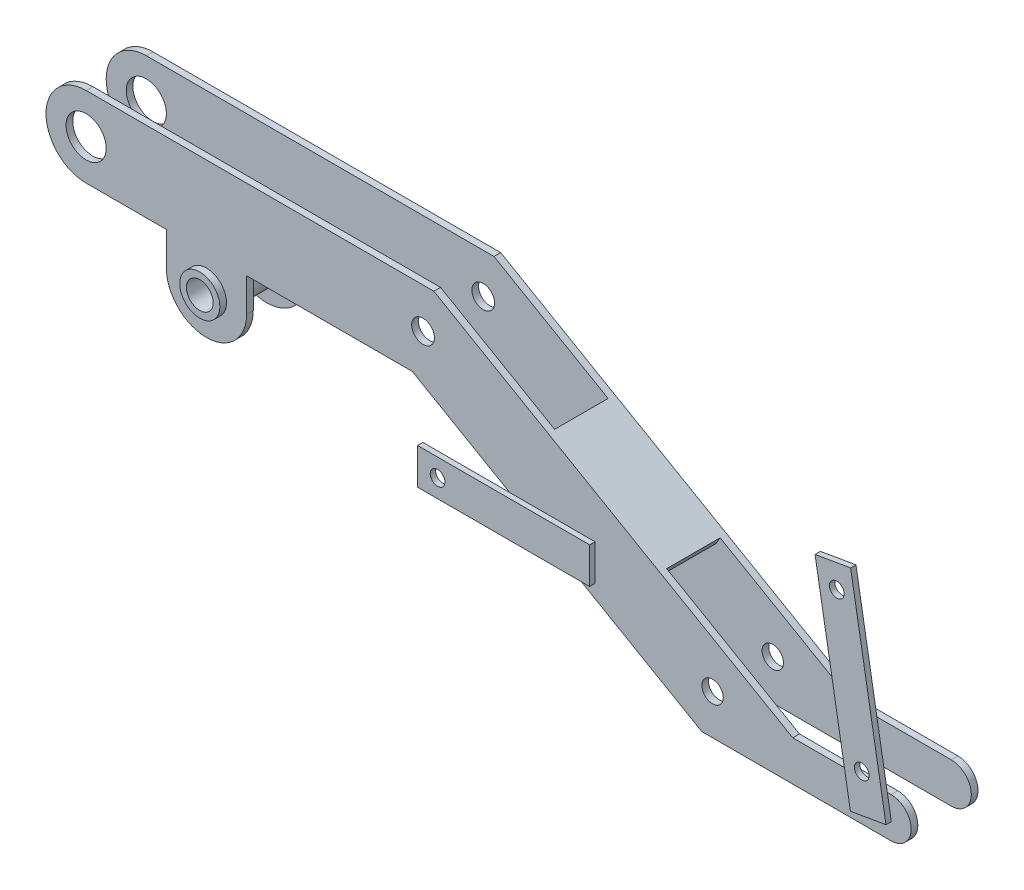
ISO-10303-21;
HEADER;
FILE_DESCRIPTION(('STEP AP214'),'2;1');
FILE_NAME('part.step','',(''),(''),'','','');
FILE_SCHEMA(('AUTOMOTIVE_DESIGN { 1 0 10303 214 1 1 1 1 }'));
ENDSEC;
DATA;
#1=APPLICATION_CONTEXT('core data for automotive mechanical design processes');
#2=APPLICATION_PROTOCOL_DEFINITION('international standard','automotive_design',2000,#1);
#3=PRODUCT_CONTEXT('',#1,'mechanical');
#4=PRODUCT('Part','Part','',(#3));
#5=PRODUCT_RELATED_PRODUCT_CATEGORY('part','',(#4));
#6=PRODUCT_DEFINITION_FORMATION('','',#4);
#7=PRODUCT_DEFINITION_CONTEXT('part definition',#1,'design');
#8=PRODUCT_DEFINITION('design','',#6,#7);
#9=PRODUCT_DEFINITION_SHAPE('','',#8);
#10=(LENGTH_UNIT() NAMED_UNIT(*) SI_UNIT(.MILLI.,.METRE.));
#11=(NAMED_UNIT(*) PLANE_ANGLE_UNIT() SI_UNIT($,.RADIAN.));
#12=(NAMED_UNIT(*) SI_UNIT($,.STERADIAN.) SOLID_ANGLE_UNIT());
#13=UNCERTAINTY_MEASURE_WITH_UNIT(LENGTH_MEASURE(1.E-05),#10,'distance_accuracy_value','');
#14=(GEOMETRIC_REPRESENTATION_CONTEXT(3) GLOBAL_UNCERTAINTY_ASSIGNED_CONTEXT((#13)) GLOBAL_UNIT_ASSIGNED_CONTEXT((#10,
#11,#12)) REPRESENTATION_CONTEXT('',''));
#15=CARTESIAN_POINT('',(0.,0.,0.));
#16=DIRECTION('',(0.,0.,1.));
#17=DIRECTION('',(1.,0.,0.));
#18=AXIS2_PLACEMENT_3D('',#15,#16,#17);
#19=CARTESIAN_POINT('',(0.,0.,5.));
#20=DIRECTION('',(0.,0.,1.));
#21=DIRECTION('',(1.,0.,0.));
#22=AXIS2_PLACEMENT_3D('',#19,#20,#21);
#23=PLANE('',#22);
#24=CARTESIAN_POINT('',(468.467875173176,-125.,5.));
#25=DIRECTION('',(0.,0.,1.));
#26=DIRECTION('',(1.,0.,0.));
#27=AXIS2_PLACEMENT_3D('',#24,#25,#26);
#28=CIRCLE('',#27,7.99999999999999);
#29=CARTESIAN_POINT('',(476.467875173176,-125.,5.));
#30=VERTEX_POINT('',#29);
#31=EDGE_CURVE('E584',#30,#30,#28,.T.);
#32=ORIENTED_EDGE('',*,*,#31,.F.);
#33=EDGE_LOOP('',(#32));
#34=FACE_BOUND('',#33,.T.);
#35=CARTESIAN_POINT('',(0.,0.,5.));
#36=DIRECTION('',(0.,0.,1.));
#37=DIRECTION('',(1.,0.,0.));
#38=AXIS2_PLACEMENT_3D('',#35,#36,#37);
#39=CIRCLE('',#38,15.);
#40=CARTESIAN_POINT('',(15.,0.,5.));
#41=VERTEX_POINT('',#40);
#42=EDGE_CURVE('E593',#41,#41,#39,.T.);
#43=ORIENTED_EDGE('',*,*,#42,.F.);
#44=EDGE_LOOP('',(#43));
#45=FACE_BOUND('',#44,.T.);
#46=CARTESIAN_POINT('',(90.,-55.,5.));
#47=DIRECTION('',(0.,0.,1.));
#48=DIRECTION('',(1.,0.,0.));
#49=AXIS2_PLACEMENT_3D('',#46,#47,#48);
#50=CIRCLE('',#49,15.);
#51=CARTESIAN_POINT('',(105.,-55.,5.));
#52=VERTEX_POINT('',#51);
#53=EDGE_CURVE('E587',#52,#52,#50,.T.);
#54=ORIENTED_EDGE('',*,*,#53,.F.);
#55=EDGE_LOOP('',(#54));
#56=FACE_BOUND('',#55,.T.);
#57=CARTESIAN_POINT('',(251.961524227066,0.,5.));
#58=DIRECTION('',(0.,0.,1.));
#59=DIRECTION('',(1.,0.,0.));
#60=AXIS2_PLACEMENT_3D('',#57,#58,#59);
#61=CIRCLE('',#60,8.50000000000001);
#62=CARTESIAN_POINT('',(260.461524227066,0.,5.));
#63=VERTEX_POINT('',#62);
#64=EDGE_CURVE('E578',#63,#63,#61,.T.);
#65=ORIENTED_EDGE('',*,*,#64,.F.);
#66=EDGE_LOOP('',(#65));
#67=FACE_BOUND('',#66,.T.);
#68=DIRECTION('',(0.866025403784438,-0.500000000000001,0.));
#69=VECTOR('',#68,1.);
#70=CARTESIAN_POINT('',(243.923048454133,-30.,5.));
#71=LINE('',#70,#69);
#72=CARTESIAN_POINT('',(243.923048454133,-30.,5.));
#73=VERTEX_POINT('',#72);
#74=CARTESIAN_POINT('',(316.650260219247,-71.98907529,5.));
#75=VERTEX_POINT('',#74);
#76=EDGE_CURVE('E639',#73,#75,#71,.T.);
#77=ORIENTED_EDGE('',*,*,#76,.T.);
#78=DIRECTION('',(-1.,0.,0.));
#79=VECTOR('',#78,1.);
#80=CARTESIAN_POINT('',(380.55170042,-71.98907529,5.));
#81=LINE('',#80,#79);
#82=CARTESIAN_POINT('',(380.55170042,-71.98907529,5.));
#83=VERTEX_POINT('',#82);
#84=EDGE_CURVE('E41',#83,#75,#81,.T.);
#85=ORIENTED_EDGE('',*,*,#84,.F.);
#86=DIRECTION('',(0.,1.,0.));
#87=VECTOR('',#86,1.);
#88=CARTESIAN_POINT('',(380.55170042,-71.98907529,5.));
#89=LINE('',#88,#87);
#90=CARTESIAN_POINT('',(380.55170042,-98.98907529,5.));
#91=VERTEX_POINT('',#90);
#92=EDGE_CURVE('E46',#91,#83,#89,.T.);
#93=ORIENTED_EDGE('',*,*,#92,.F.);
#94=DIRECTION('',(1.,0.,0.));
#95=VECTOR('',#94,1.);
#96=CARTESIAN_POINT('',(380.55170042,-98.98907529,5.));
#97=LINE('',#96,#95);
#98=CARTESIAN_POINT('',(363.415632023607,-98.98907529,5.));
#99=VERTEX_POINT('',#98);
#100=EDGE_CURVE('E318',#99,#91,#97,.T.);
#101=ORIENTED_EDGE('',*,*,#100,.F.);
#102=CARTESIAN_POINT('',(460.429399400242,-155.,5.));
#103=VERTEX_POINT('',#102);
#104=EDGE_CURVE('E638',#99,#103,#71,.T.);
#105=ORIENTED_EDGE('',*,*,#104,.T.);
#106=DIRECTION('',(1.,0.,0.));
#107=VECTOR('',#106,1.);
#108=CARTESIAN_POINT('',(460.429399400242,-155.,5.));
#109=LINE('',#108,#107);
#110=CARTESIAN_POINT('',(601.961524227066,-155.,5.));
#111=VERTEX_POINT('',#110);
#112=EDGE_CURVE('E641',#103,#111,#109,.T.);
#113=ORIENTED_EDGE('',*,*,#112,.T.);
#114=CARTESIAN_POINT('',(601.961524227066,-140.,5.));
#115=DIRECTION('',(0.,0.,1.));
#116=DIRECTION('',(-1.,0.,0.));
#117=AXIS2_PLACEMENT_3D('',#114,#115,#116);
#118=CIRCLE('',#117,15.);
#119=CARTESIAN_POINT('',(601.961524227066,-125.,5.));
#120=VERTEX_POINT('',#119);
#121=EDGE_CURVE('E644',#111,#120,#118,.T.);
#122=ORIENTED_EDGE('',*,*,#121,.T.);
#123=DIRECTION('',(-1.,0.,0.));
#124=VECTOR('',#123,1.);
#125=CARTESIAN_POINT('',(528.467875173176,-125.,5.));
#126=LINE('',#125,#124);
#127=CARTESIAN_POINT('',(599.147720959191,-125.,5.));
#128=VERTEX_POINT('',#127);
#129=EDGE_CURVE('E647',#120,#128,#126,.T.);
#130=ORIENTED_EDGE('',*,*,#129,.T.);
#131=DIRECTION('',(-0.170249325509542,0.985401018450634,0.));
#132=VECTOR('',#131,1.);
#133=CARTESIAN_POINT('',(602.16175276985,-142.445179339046,5.));
#134=LINE('',#133,#132);
#135=CARTESIAN_POINT('',(602.16175276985,-142.445179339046,5.));
#136=VERTEX_POINT('',#135);
#137=EDGE_CURVE('E356',#136,#128,#134,.T.);
#138=ORIENTED_EDGE('',*,*,#137,.F.);
#139=DIRECTION('',(0.985401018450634,0.17024932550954,0.));
#140=VECTOR('',#139,1.);
#141=CARTESIAN_POINT('',(575.555925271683,-147.041911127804,5.));
#142=LINE('',#141,#140);
#143=CARTESIAN_POINT('',(575.555925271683,-147.041911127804,5.));
#144=VERTEX_POINT('',#143);
#145=EDGE_CURVE('E352',#144,#136,#142,.T.);
#146=ORIENTED_EDGE('',*,*,#145,.F.);
#147=DIRECTION('',(0.170249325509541,-0.985401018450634,0.));
#148=VECTOR('',#147,1.);
#149=CARTESIAN_POINT('',(575.555925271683,-147.041911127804,5.));
#150=LINE('',#149,#148);
#151=CARTESIAN_POINT('',(571.747708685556,-125.,5.));
#152=VERTEX_POINT('',#151);
#153=EDGE_CURVE('E348',#152,#144,#150,.T.);
#154=ORIENTED_EDGE('',*,*,#153,.F.);
#155=CARTESIAN_POINT('',(528.467875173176,-125.,5.));
#156=VERTEX_POINT('',#155);
#157=EDGE_CURVE('E646',#152,#156,#126,.T.);
#158=ORIENTED_EDGE('',*,*,#157,.T.);
#159=DIRECTION('',(-0.866025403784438,0.500000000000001,0.));
#160=VECTOR('',#159,1.);
#161=CARTESIAN_POINT('',(260.,30.,5.));
#162=LINE('',#161,#160);
#163=CARTESIAN_POINT('',(260.,30.,5.));
#164=VERTEX_POINT('',#163);
#165=EDGE_CURVE('E650',#156,#164,#162,.T.);
#166=ORIENTED_EDGE('',*,*,#165,.T.);
#167=DIRECTION('',(-1.,0.,0.));
#168=VECTOR('',#167,1.);
#169=CARTESIAN_POINT('',(0.,30.,5.));
#170=LINE('',#169,#168);
#171=CARTESIAN_POINT('',(0.,30.,5.));
#172=VERTEX_POINT('',#171);
#173=EDGE_CURVE('E653',#164,#172,#170,.T.);
#174=ORIENTED_EDGE('',*,*,#173,.T.);
#175=CARTESIAN_POINT('',(0.,0.,5.));
#176=DIRECTION('',(0.,0.,1.));
#177=DIRECTION('',(1.,0.,0.));
#178=AXIS2_PLACEMENT_3D('',#175,#176,#177);
#179=CIRCLE('',#178,30.);
#180=CARTESIAN_POINT('',(0.,-30.,5.));
#181=VERTEX_POINT('',#180);
#182=EDGE_CURVE('E625',#172,#181,#179,.T.);
#183=ORIENTED_EDGE('',*,*,#182,.T.);
#184=DIRECTION('',(1.,0.,0.));
#185=VECTOR('',#184,1.);
#186=CARTESIAN_POINT('',(0.,-30.,5.));
#187=LINE('',#186,#185);
#188=CARTESIAN_POINT('',(60.,-30.,5.));
#189=VERTEX_POINT('',#188);
#190=EDGE_CURVE('E628',#181,#189,#187,.T.);
#191=ORIENTED_EDGE('',*,*,#190,.T.);
#192=DIRECTION('',(0.,-1.,0.));
#193=VECTOR('',#192,1.);
#194=CARTESIAN_POINT('',(60.,-55.,5.));
#195=LINE('',#194,#193);
#196=CARTESIAN_POINT('',(60.,-55.,5.));
#197=VERTEX_POINT('',#196);
#198=EDGE_CURVE('E630',#189,#197,#195,.T.);
#199=ORIENTED_EDGE('',*,*,#198,.T.);
#200=CARTESIAN_POINT('',(90.,-55.,5.));
#201=DIRECTION('',(0.,0.,1.));
#202=DIRECTION('',(1.,0.,0.));
#203=AXIS2_PLACEMENT_3D('',#200,#201,#202);
#204=CIRCLE('',#203,30.);
#205=CARTESIAN_POINT('',(120.,-55.,5.));
#206=VERTEX_POINT('',#205);
#207=EDGE_CURVE('E632',#197,#206,#204,.T.);
#208=ORIENTED_EDGE('',*,*,#207,.T.);
#209=DIRECTION('',(0.,1.,0.));
#210=VECTOR('',#209,1.);
#211=CARTESIAN_POINT('',(120.,-55.,5.));
#212=LINE('',#211,#210);
#213=CARTESIAN_POINT('',(120.,-30.,5.));
#214=VERTEX_POINT('',#213);
#215=EDGE_CURVE('E634',#206,#214,#212,.T.);
#216=ORIENTED_EDGE('',*,*,#215,.T.);
#217=DIRECTION('',(1.,0.,0.));
#218=VECTOR('',#217,1.);
#219=CARTESIAN_POINT('',(120.,-30.,5.));
#220=LINE('',#219,#218);
#221=EDGE_CURVE('E636',#214,#73,#220,.T.);
#222=ORIENTED_EDGE('',*,*,#221,.T.);
#223=EDGE_LOOP('',(#77,#85,#93,#101,#105,#113,#122,#130,#138,#146,#154,#158,#166,#174,#183,#191,
#199,#208,#216,#222));
#224=FACE_BOUND('',#223,.T.);
#225=ADVANCED_FACE('F26',(#34,#45,#56,#67,#224),#23,.T.);
#226=CARTESIAN_POINT('',(0.,0.,0.));
#227=DIRECTION('',(0.,0.,1.));
#228=DIRECTION('',(1.,0.,0.));
#229=AXIS2_PLACEMENT_3D('',#226,#227,#228);
#230=PLANE('',#229);
#231=CARTESIAN_POINT('',(468.467875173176,-125.,0.));
#232=DIRECTION('',(0.,0.,1.));
#233=DIRECTION('',(1.,0.,0.));
#234=AXIS2_PLACEMENT_3D('',#231,#232,#233);
#235=CIRCLE('',#234,7.99999999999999);
#236=CARTESIAN_POINT('',(476.467875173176,-125.,0.));
#237=VERTEX_POINT('',#236);
#238=EDGE_CURVE('E581',#237,#237,#235,.T.);
#239=ORIENTED_EDGE('',*,*,#238,.T.);
#240=EDGE_LOOP('',(#239));
#241=FACE_BOUND('',#240,.T.);
#242=CARTESIAN_POINT('',(0.,0.,0.));
#243=DIRECTION('',(0.,0.,1.));
#244=DIRECTION('',(1.,0.,0.));
#245=AXIS2_PLACEMENT_3D('',#242,#243,#244);
#246=CIRCLE('',#245,15.);
#247=CARTESIAN_POINT('',(15.,0.,0.));
#248=VERTEX_POINT('',#247);
#249=EDGE_CURVE('E590',#248,#248,#246,.T.);
#250=ORIENTED_EDGE('',*,*,#249,.T.);
#251=EDGE_LOOP('',(#250));
#252=FACE_BOUND('',#251,.T.);
#253=CARTESIAN_POINT('',(251.961524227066,0.,0.));
#254=DIRECTION('',(0.,0.,1.));
#255=DIRECTION('',(1.,0.,0.));
#256=AXIS2_PLACEMENT_3D('',#253,#254,#255);
#257=CIRCLE('',#256,8.50000000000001);
#258=CARTESIAN_POINT('',(260.461524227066,0.,0.));
#259=VERTEX_POINT('',#258);
#260=EDGE_CURVE('E575',#259,#259,#257,.T.);
#261=ORIENTED_EDGE('',*,*,#260,.T.);
#262=EDGE_LOOP('',(#261));
#263=FACE_BOUND('',#262,.T.);
#264=DIRECTION('',(-0.500000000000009,-0.866025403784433,0.));
#265=VECTOR('',#264,1.);
#266=CARTESIAN_POINT('',(429.119905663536,-67.6414230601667,0.));
#267=LINE('',#266,#265);
#268=CARTESIAN_POINT('',(429.119905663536,-67.6414230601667,0.));
#269=VERTEX_POINT('',#268);
#270=CARTESIAN_POINT('',(426.119905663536,-72.8375754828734,0.));
#271=VERTEX_POINT('',#270);
#272=EDGE_CURVE('E530',#269,#271,#267,.T.);
#273=ORIENTED_EDGE('',*,*,#272,.F.);
#274=DIRECTION('',(-0.866025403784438,0.500000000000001,0.));
#275=VECTOR('',#274,1.);
#276=CARTESIAN_POINT('',(260.,30.,0.));
#277=LINE('',#276,#275);
#278=CARTESIAN_POINT('',(528.467875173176,-125.,0.));
#279=VERTEX_POINT('',#278);
#280=EDGE_CURVE('E620',#279,#269,#277,.T.);
#281=ORIENTED_EDGE('',*,*,#280,.F.);
#282=DIRECTION('',(-1.,0.,0.));
#283=VECTOR('',#282,1.);
#284=CARTESIAN_POINT('',(528.467875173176,-125.,0.));
#285=LINE('',#284,#283);
#286=CARTESIAN_POINT('',(601.961524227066,-125.,0.));
#287=VERTEX_POINT('',#286);
#288=EDGE_CURVE('E617',#287,#279,#285,.T.);
#289=ORIENTED_EDGE('',*,*,#288,.F.);
#290=CARTESIAN_POINT('',(601.961524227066,-140.,0.));
#291=DIRECTION('',(0.,0.,1.));
#292=DIRECTION('',(-1.,0.,0.));
#293=AXIS2_PLACEMENT_3D('',#290,#291,#292);
#294=CIRCLE('',#293,15.);
#295=CARTESIAN_POINT('',(601.961524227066,-155.,0.));
#296=VERTEX_POINT('',#295);
#297=EDGE_CURVE('E615',#296,#287,#294,.T.);
#298=ORIENTED_EDGE('',*,*,#297,.F.);
#299=DIRECTION('',(1.,0.,0.));
#300=VECTOR('',#299,1.);
#301=CARTESIAN_POINT('',(460.429399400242,-155.,0.));
#302=LINE('',#301,#300);
#303=CARTESIAN_POINT('',(460.429399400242,-155.,0.));
#304=VERTEX_POINT('',#303);
#305=EDGE_CURVE('E613',#304,#296,#302,.T.);
#306=ORIENTED_EDGE('',*,*,#305,.F.);
#307=DIRECTION('',(0.866025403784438,-0.500000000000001,0.));
#308=VECTOR('',#307,1.);
#309=CARTESIAN_POINT('',(243.923048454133,-30.,0.));
#310=LINE('',#309,#308);
#311=CARTESIAN_POINT('',(243.923048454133,-30.,0.));
#312=VERTEX_POINT('',#311);
#313=EDGE_CURVE('E611',#312,#304,#310,.T.);
#314=ORIENTED_EDGE('',*,*,#313,.F.);
#315=DIRECTION('',(1.,0.,0.));
#316=VECTOR('',#315,1.);
#317=CARTESIAN_POINT('',(120.,-30.,0.));
#318=LINE('',#317,#316);
#319=CARTESIAN_POINT('',(122.,-30.,0.));
#320=VERTEX_POINT('',#319);
#321=EDGE_CURVE('E609',#320,#312,#318,.T.);
#322=ORIENTED_EDGE('',*,*,#321,.F.);
#323=DIRECTION('',(0.,-1.,0.));
#324=VECTOR('',#323,1.);
#325=CARTESIAN_POINT('',(122.,-25.,0.));
#326=LINE('',#325,#324);
#327=CARTESIAN_POINT('',(122.,-25.,0.));
#328=VERTEX_POINT('',#327);
#329=EDGE_CURVE('E547',#328,#320,#326,.T.);
#330=ORIENTED_EDGE('',*,*,#329,.F.);
#331=DIRECTION('',(1.,0.,0.));
#332=VECTOR('',#331,1.);
#333=CARTESIAN_POINT('',(122.,-25.,0.));
#334=LINE('',#333,#332);
#335=CARTESIAN_POINT('',(57.,-25.,0.));
#336=VERTEX_POINT('',#335);
#337=EDGE_CURVE('E555',#336,#328,#334,.T.);
#338=ORIENTED_EDGE('',*,*,#337,.F.);
#339=DIRECTION('',(0.,1.,0.));
#340=VECTOR('',#339,1.);
#341=CARTESIAN_POINT('',(57.,-25.,0.));
#342=LINE('',#341,#340);
#343=CARTESIAN_POINT('',(57.,-30.,0.));
#344=VERTEX_POINT('',#343);
#345=EDGE_CURVE('E552',#344,#336,#342,.T.);
#346=ORIENTED_EDGE('',*,*,#345,.F.);
#347=DIRECTION('',(1.,0.,0.));
#348=VECTOR('',#347,1.);
#349=CARTESIAN_POINT('',(0.,-30.,0.));
#350=LINE('',#349,#348);
#351=CARTESIAN_POINT('',(0.,-30.,0.));
#352=VERTEX_POINT('',#351);
#353=EDGE_CURVE('E599',#352,#344,#350,.T.);
#354=ORIENTED_EDGE('',*,*,#353,.F.);
#355=CARTESIAN_POINT('',(0.,0.,0.));
#356=DIRECTION('',(0.,0.,1.));
#357=DIRECTION('',(1.,0.,0.));
#358=AXIS2_PLACEMENT_3D('',#355,#356,#357);
#359=CIRCLE('',#358,30.);
#360=CARTESIAN_POINT('',(0.,30.,0.));
#361=VERTEX_POINT('',#360);
#362=EDGE_CURVE('E596',#361,#352,#359,.T.);
#363=ORIENTED_EDGE('',*,*,#362,.F.);
#364=DIRECTION('',(-1.,0.,0.));
#365=VECTOR('',#364,1.);
#366=CARTESIAN_POINT('',(0.,30.,0.));
#367=LINE('',#366,#365);
#368=CARTESIAN_POINT('',(260.,30.,0.));
#369=VERTEX_POINT('',#368);
#370=EDGE_CURVE('E623',#369,#361,#367,.T.);
#371=ORIENTED_EDGE('',*,*,#370,.F.);
#372=CARTESIAN_POINT('',(345.362174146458,-19.2838742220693,0.));
#373=VERTEX_POINT('',#372);
#374=EDGE_CURVE('E619',#373,#369,#277,.T.);
#375=ORIENTED_EDGE('',*,*,#374,.F.);
#376=DIRECTION('',(0.499999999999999,0.866025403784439,0.));
#377=VECTOR('',#376,1.);
#378=CARTESIAN_POINT('',(345.362174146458,-19.2838742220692,0.));
#379=LINE('',#378,#377);
#380=CARTESIAN_POINT('',(342.362174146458,-24.4800266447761,0.));
#381=VERTEX_POINT('',#380);
#382=EDGE_CURVE('E536',#381,#373,#379,.T.);
#383=ORIENTED_EDGE('',*,*,#382,.F.);
#384=DIRECTION('',(-0.866025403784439,0.5,0.));
#385=VECTOR('',#384,1.);
#386=CARTESIAN_POINT('',(426.119905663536,-72.8375754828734,0.));
#387=LINE('',#386,#385);
#388=EDGE_CURVE('E533',#271,#381,#387,.T.);
#389=ORIENTED_EDGE('',*,*,#388,.F.);
#390=EDGE_LOOP('',(#273,#281,#289,#298,#306,#314,#322,#330,#338,#346,#354,#363,#371,#375,#383,#389));
#391=FACE_BOUND('',#390,.T.);
#392=ADVANCED_FACE('F715',(#241,#252,#263,#391),#230,.F.);
#393=CARTESIAN_POINT('',(90.,-55.,0.));
#394=DIRECTION('',(0.,0.,1.));
#395=DIRECTION('',(1.,0.,0.));
#396=AXIS2_PLACEMENT_3D('',#393,#394,#395);
#397=CIRCLE('',#396,15.);
#398=CARTESIAN_POINT('',(105.,-55.,0.));
#399=VERTEX_POINT('',#398);
#400=EDGE_CURVE('E572',#399,#399,#397,.F.);
#401=ORIENTED_EDGE('',*,*,#400,.F.);
#402=EDGE_LOOP('',(#401));
#403=FACE_BOUND('',#402,.T.);
#404=DIRECTION('',(-1.,0.,0.));
#405=VECTOR('',#404,1.);
#406=CARTESIAN_POINT('',(122.,-30.,0.));
#407=LINE('',#406,#405);
#408=CARTESIAN_POINT('',(120.,-30.,0.));
#409=VERTEX_POINT('',#408);
#410=CARTESIAN_POINT('',(60.,-30.,0.));
#411=VERTEX_POINT('',#410);
#412=EDGE_CURVE('E550',#409,#411,#407,.T.);
#413=ORIENTED_EDGE('',*,*,#412,.F.);
#414=DIRECTION('',(0.,1.,0.));
#415=VECTOR('',#414,1.);
#416=CARTESIAN_POINT('',(120.,-55.,0.));
#417=LINE('',#416,#415);
#418=CARTESIAN_POINT('',(120.,-55.,0.));
#419=VERTEX_POINT('',#418);
#420=EDGE_CURVE('E606',#419,#409,#417,.T.);
#421=ORIENTED_EDGE('',*,*,#420,.F.);
#422=CARTESIAN_POINT('',(90.,-55.,0.));
#423=DIRECTION('',(0.,0.,1.));
#424=DIRECTION('',(1.,0.,0.));
#425=AXIS2_PLACEMENT_3D('',#422,#423,#424);
#426=CIRCLE('',#425,30.);
#427=CARTESIAN_POINT('',(60.,-55.,0.));
#428=VERTEX_POINT('',#427);
#429=EDGE_CURVE('E604',#428,#419,#426,.T.);
#430=ORIENTED_EDGE('',*,*,#429,.F.);
#431=DIRECTION('',(0.,-1.,0.));
#432=VECTOR('',#431,1.);
#433=CARTESIAN_POINT('',(60.,-55.,0.));
#434=LINE('',#433,#432);
#435=EDGE_CURVE('E602',#411,#428,#434,.T.);
#436=ORIENTED_EDGE('',*,*,#435,.F.);
#437=EDGE_LOOP('',(#413,#421,#430,#436));
#438=FACE_BOUND('',#437,.T.);
#439=ADVANCED_FACE('F694',(#403,#438),#230,.F.);
#440=CARTESIAN_POINT('',(0.,0.,5.));
#441=DIRECTION('',(0.,0.,-1.));
#442=DIRECTION('',(-1.,0.,0.));
#443=AXIS2_PLACEMENT_3D('',#440,#441,#442);
#444=CYLINDRICAL_SURFACE('',#443,30.);
#445=ORIENTED_EDGE('',*,*,#362,.T.);
#446=DIRECTION('',(0.,0.,-1.));
#447=VECTOR('',#446,1.);
#448=CARTESIAN_POINT('',(0.,-30.,5.));
#449=LINE('',#448,#447);
#450=EDGE_CURVE('E11',#181,#352,#449,.T.);
#451=ORIENTED_EDGE('',*,*,#450,.F.);
#452=ORIENTED_EDGE('',*,*,#182,.F.);
#453=DIRECTION('',(0.,0.,-1.));
#454=VECTOR('',#453,1.);
#455=CARTESIAN_POINT('',(0.,30.,5.));
#456=LINE('',#455,#454);
#457=EDGE_CURVE('E655',#172,#361,#456,.T.);
#458=ORIENTED_EDGE('',*,*,#457,.T.);
#459=EDGE_LOOP('',(#445,#451,#452,#458));
#460=FACE_BOUND('',#459,.T.);
#461=ADVANCED_FACE('F28',(#460),#444,.T.);
#462=CARTESIAN_POINT('',(60.,-55.,5.));
#463=DIRECTION('',(1.,0.,0.));
#464=DIRECTION('',(0.,0.,-1.));
#465=AXIS2_PLACEMENT_3D('',#462,#463,#464);
#466=PLANE('',#465);
#467=ORIENTED_EDGE('',*,*,#435,.T.);
#468=DIRECTION('',(0.,0.,-1.));
#469=VECTOR('',#468,1.);
#470=CARTESIAN_POINT('',(60.,-55.,5.));
#471=LINE('',#470,#469);
#472=EDGE_CURVE('E682',#197,#428,#471,.T.);
#473=ORIENTED_EDGE('',*,*,#472,.F.);
#474=ORIENTED_EDGE('',*,*,#198,.F.);
#475=DIRECTION('',(0.,0.,-1.));
#476=VECTOR('',#475,1.);
#477=CARTESIAN_POINT('',(60.,-30.,5.));
#478=LINE('',#477,#476);
#479=EDGE_CURVE('E34',#189,#411,#478,.T.);
#480=ORIENTED_EDGE('',*,*,#479,.T.);
#481=EDGE_LOOP('',(#467,#473,#474,#480));
#482=FACE_BOUND('',#481,.T.);
#483=ADVANCED_FACE('F689',(#482),#466,.F.);
#484=CARTESIAN_POINT('',(90.,-55.,5.));
#485=DIRECTION('',(0.,0.,-1.));
#486=DIRECTION('',(-1.,0.,0.));
#487=AXIS2_PLACEMENT_3D('',#484,#485,#486);
#488=CYLINDRICAL_SURFACE('',#487,30.);
#489=ORIENTED_EDGE('',*,*,#429,.T.);
#490=DIRECTION('',(0.,0.,-1.));
#491=VECTOR('',#490,1.);
#492=CARTESIAN_POINT('',(120.,-55.,5.));
#493=LINE('',#492,#491);
#494=EDGE_CURVE('E679',#206,#419,#493,.T.);
#495=ORIENTED_EDGE('',*,*,#494,.F.);
#496=ORIENTED_EDGE('',*,*,#207,.F.);
#497=ORIENTED_EDGE('',*,*,#472,.T.);
#498=EDGE_LOOP('',(#489,#495,#496,#497));
#499=FACE_BOUND('',#498,.T.);
#500=ADVANCED_FACE('F698',(#499),#488,.T.);
#501=CARTESIAN_POINT('',(120.,-55.,5.));
#502=DIRECTION('',(-1.,0.,0.));
#503=DIRECTION('',(0.,0.,1.));
#504=AXIS2_PLACEMENT_3D('',#501,#502,#503);
#505=PLANE('',#504);
#506=ORIENTED_EDGE('',*,*,#420,.T.);
#507=DIRECTION('',(0.,0.,-1.));
#508=VECTOR('',#507,1.);
#509=CARTESIAN_POINT('',(120.,-30.,5.));
#510=LINE('',#509,#508);
#511=EDGE_CURVE('E676',#214,#409,#510,.T.);
#512=ORIENTED_EDGE('',*,*,#511,.F.);
#513=ORIENTED_EDGE('',*,*,#215,.F.);
#514=ORIENTED_EDGE('',*,*,#494,.T.);
#515=EDGE_LOOP('',(#506,#512,#513,#514));
#516=FACE_BOUND('',#515,.T.);
#517=ADVANCED_FACE('F702',(#516),#505,.F.);
#518=CARTESIAN_POINT('',(120.,-30.,5.));
#519=DIRECTION('',(0.,1.,0.));
#520=DIRECTION('',(0.,0.,1.));
#521=AXIS2_PLACEMENT_3D('',#518,#519,#520);
#522=PLANE('',#521);
#523=ORIENTED_EDGE('',*,*,#353,.T.);
#524=DIRECTION('',(0.,0.,1.));
#525=VECTOR('',#524,1.);
#526=CARTESIAN_POINT('',(57.,-30.,-30.));
#527=LINE('',#526,#525);
#528=CARTESIAN_POINT('',(57.,-30.,-40.));
#529=VERTEX_POINT('',#528);
#530=EDGE_CURVE('E562',#529,#344,#527,.T.);
#531=ORIENTED_EDGE('',*,*,#530,.F.);
#532=DIRECTION('',(1.,0.,0.));
#533=VECTOR('',#532,1.);
#534=CARTESIAN_POINT('',(0.,-30.,-40.));
#535=LINE('',#534,#533);
#536=CARTESIAN_POINT('',(0.,-30.,-40.));
#537=VERTEX_POINT('',#536);
#538=EDGE_CURVE('E436',#537,#529,#535,.T.);
#539=ORIENTED_EDGE('',*,*,#538,.F.);
#540=DIRECTION('',(0.,0.,1.));
#541=VECTOR('',#540,1.);
#542=CARTESIAN_POINT('',(0.,-30.,-45.));
#543=LINE('',#542,#541);
#544=CARTESIAN_POINT('',(0.,-30.,-45.));
#545=VERTEX_POINT('',#544);
#546=EDGE_CURVE('E528',#545,#537,#543,.T.);
#547=ORIENTED_EDGE('',*,*,#546,.F.);
#548=DIRECTION('',(1.,0.,0.));
#549=VECTOR('',#548,1.);
#550=CARTESIAN_POINT('',(0.,-30.,-45.));
#551=LINE('',#550,#549);
#552=CARTESIAN_POINT('',(60.,-30.,-45.));
#553=VERTEX_POINT('',#552);
#554=EDGE_CURVE('E473',#545,#553,#551,.T.);
#555=ORIENTED_EDGE('',*,*,#554,.T.);
#556=DIRECTION('',(0.,0.,1.));
#557=VECTOR('',#556,1.);
#558=CARTESIAN_POINT('',(60.,-30.,-45.));
#559=LINE('',#558,#557);
#560=CARTESIAN_POINT('',(60.,-30.,-40.));
#561=VERTEX_POINT('',#560);
#562=EDGE_CURVE('E526',#553,#561,#559,.T.);
#563=ORIENTED_EDGE('',*,*,#562,.T.);
#564=DIRECTION('',(-1.,0.,0.));
#565=VECTOR('',#564,1.);
#566=CARTESIAN_POINT('',(122.,-30.,-40.));
#567=LINE('',#566,#565);
#568=CARTESIAN_POINT('',(120.,-30.,-40.));
#569=VERTEX_POINT('',#568);
#570=EDGE_CURVE('E394',#569,#561,#567,.T.);
#571=ORIENTED_EDGE('',*,*,#570,.F.);
#572=DIRECTION('',(0.,0.,1.));
#573=VECTOR('',#572,1.);
#574=CARTESIAN_POINT('',(120.,-30.,-45.));
#575=LINE('',#574,#573);
#576=CARTESIAN_POINT('',(120.,-30.,-45.));
#577=VERTEX_POINT('',#576);
#578=EDGE_CURVE('E520',#577,#569,#575,.T.);
#579=ORIENTED_EDGE('',*,*,#578,.F.);
#580=DIRECTION('',(1.,0.,0.));
#581=VECTOR('',#580,1.);
#582=CARTESIAN_POINT('',(120.,-30.,-45.));
#583=LINE('',#582,#581);
#584=CARTESIAN_POINT('',(243.923048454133,-30.,-45.));
#585=VERTEX_POINT('',#584);
#586=EDGE_CURVE('E485',#577,#585,#583,.T.);
#587=ORIENTED_EDGE('',*,*,#586,.T.);
#588=DIRECTION('',(0.,0.,1.));
#589=VECTOR('',#588,1.);
#590=CARTESIAN_POINT('',(243.923048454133,-30.,-45.));
#591=LINE('',#590,#589);
#592=CARTESIAN_POINT('',(243.923048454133,-30.,-40.));
#593=VERTEX_POINT('',#592);
#594=EDGE_CURVE('E518',#585,#593,#591,.T.);
#595=ORIENTED_EDGE('',*,*,#594,.T.);
#596=DIRECTION('',(1.,0.,0.));
#597=VECTOR('',#596,1.);
#598=CARTESIAN_POINT('',(120.,-30.,-40.));
#599=LINE('',#598,#597);
#600=CARTESIAN_POINT('',(122.,-30.,-40.));
#601=VERTEX_POINT('',#600);
#602=EDGE_CURVE('E448',#601,#593,#599,.T.);
#603=ORIENTED_EDGE('',*,*,#602,.F.);
#604=DIRECTION('',(0.,0.,1.));
#605=VECTOR('',#604,1.);
#606=CARTESIAN_POINT('',(122.,-30.,-30.));
#607=LINE('',#606,#605);
#608=EDGE_CURVE('E564',#601,#320,#607,.T.);
#609=ORIENTED_EDGE('',*,*,#608,.T.);
#610=ORIENTED_EDGE('',*,*,#321,.T.);
#611=DIRECTION('',(0.,0.,-1.));
#612=VECTOR('',#611,1.);
#613=CARTESIAN_POINT('',(243.923048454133,-30.,5.));
#614=LINE('',#613,#612);
#615=EDGE_CURVE('E673',#73,#312,#614,.T.);
#616=ORIENTED_EDGE('',*,*,#615,.F.);
#617=ORIENTED_EDGE('',*,*,#221,.F.);
#618=ORIENTED_EDGE('',*,*,#511,.T.);
#619=ORIENTED_EDGE('',*,*,#412,.T.);
#620=ORIENTED_EDGE('',*,*,#479,.F.);
#621=ORIENTED_EDGE('',*,*,#190,.F.);
#622=ORIENTED_EDGE('',*,*,#450,.T.);
#623=EDGE_LOOP('',(#523,#531,#539,#547,#555,#563,#571,#579,#587,#595,#603,#609,#610,#616,#617,
#618,#619,#620,#621,#622));
#624=FACE_BOUND('',#623,.T.);
#625=ADVANCED_FACE('F708',(#624),#522,.F.);
#626=CARTESIAN_POINT('',(243.923048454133,-30.,5.));
#627=DIRECTION('',(0.500000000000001,0.866025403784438,0.));
#628=DIRECTION('',(-0.866025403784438,0.500000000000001,0.));
#629=AXIS2_PLACEMENT_3D('',#626,#627,#628);
#630=PLANE('',#629);
#631=ORIENTED_EDGE('',*,*,#313,.T.);
#632=DIRECTION('',(0.,0.,-1.));
#633=VECTOR('',#632,1.);
#634=CARTESIAN_POINT('',(460.429399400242,-155.,5.));
#635=LINE('',#634,#633);
#636=EDGE_CURVE('E670',#103,#304,#635,.T.);
#637=ORIENTED_EDGE('',*,*,#636,.F.);
#638=ORIENTED_EDGE('',*,*,#104,.F.);
#639=EDGE_CURVE('E642',#75,#99,#71,.T.);
#640=ORIENTED_EDGE('',*,*,#639,.F.);
#641=ORIENTED_EDGE('',*,*,#76,.F.);
#642=ORIENTED_EDGE('',*,*,#615,.T.);
#643=EDGE_LOOP('',(#631,#637,#638,#640,#641,#642));
#644=FACE_BOUND('',#643,.T.);
#645=ADVANCED_FACE('F770',(#644),#630,.F.);
#646=CARTESIAN_POINT('',(460.429399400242,-155.,5.));
#647=DIRECTION('',(0.,1.,0.));
#648=DIRECTION('',(-1.,0.,0.));
#649=AXIS2_PLACEMENT_3D('',#646,#647,#648);
#650=PLANE('',#649);
#651=ORIENTED_EDGE('',*,*,#305,.T.);
#652=DIRECTION('',(0.,0.,-1.));
#653=VECTOR('',#652,1.);
#654=CARTESIAN_POINT('',(601.961524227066,-155.,5.));
#655=LINE('',#654,#653);
#656=EDGE_CURVE('E667',#111,#296,#655,.T.);
#657=ORIENTED_EDGE('',*,*,#656,.F.);
#658=ORIENTED_EDGE('',*,*,#112,.F.);
#659=ORIENTED_EDGE('',*,*,#636,.T.);
#660=EDGE_LOOP('',(#651,#657,#658,#659));
#661=FACE_BOUND('',#660,.T.);
#662=ADVANCED_FACE('F774',(#661),#650,.F.);
#663=CARTESIAN_POINT('',(601.961524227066,-140.,5.));
#664=DIRECTION('',(0.,0.,-1.));
#665=DIRECTION('',(-1.,0.,0.));
#666=AXIS2_PLACEMENT_3D('',#663,#664,#665);
#667=CYLINDRICAL_SURFACE('',#666,15.);
#668=ORIENTED_EDGE('',*,*,#297,.T.);
#669=DIRECTION('',(0.,0.,-1.));
#670=VECTOR('',#669,1.);
#671=CARTESIAN_POINT('',(601.961524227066,-125.,5.));
#672=LINE('',#671,#670);
#673=EDGE_CURVE('E664',#120,#287,#672,.T.);
#674=ORIENTED_EDGE('',*,*,#673,.F.);
#675=ORIENTED_EDGE('',*,*,#121,.F.);
#676=ORIENTED_EDGE('',*,*,#656,.T.);
#677=EDGE_LOOP('',(#668,#674,#675,#676));
#678=FACE_BOUND('',#677,.T.);
#679=ADVANCED_FACE('F833',(#678),#667,.T.);
#680=CARTESIAN_POINT('',(528.467875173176,-125.,5.));
#681=DIRECTION('',(0.,-1.,0.));
#682=DIRECTION('',(0.,0.,-1.));
#683=AXIS2_PLACEMENT_3D('',#680,#681,#682);
#684=PLANE('',#683);
#685=ORIENTED_EDGE('',*,*,#288,.T.);
#686=DIRECTION('',(0.,0.,-1.));
#687=VECTOR('',#686,1.);
#688=CARTESIAN_POINT('',(528.467875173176,-125.,5.));
#689=LINE('',#688,#687);
#690=EDGE_CURVE('E661',#156,#279,#689,.T.);
#691=ORIENTED_EDGE('',*,*,#690,.F.);
#692=ORIENTED_EDGE('',*,*,#157,.F.);
#693=EDGE_CURVE('E651',#128,#152,#126,.T.);
#694=ORIENTED_EDGE('',*,*,#693,.F.);
#695=ORIENTED_EDGE('',*,*,#129,.F.);
#696=ORIENTED_EDGE('',*,*,#673,.T.);
#697=EDGE_LOOP('',(#685,#691,#692,#694,#695,#696));
#698=FACE_BOUND('',#697,.T.);
#699=ADVANCED_FACE('F829',(#698),#684,.F.);
#700=CARTESIAN_POINT('',(260.,30.,5.));
#701=DIRECTION('',(-0.500000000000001,-0.866025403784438,0.));
#702=DIRECTION('',(0.866025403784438,-0.500000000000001,0.));
#703=AXIS2_PLACEMENT_3D('',#700,#701,#702);
#704=PLANE('',#703);
#705=ORIENTED_EDGE('',*,*,#280,.T.);
#706=DIRECTION('',(0.,0.,1.));
#707=VECTOR('',#706,1.);
#708=CARTESIAN_POINT('',(429.119905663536,-67.6414230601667,-30.));
#709=LINE('',#708,#707);
#710=CARTESIAN_POINT('',(429.119905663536,-67.6414230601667,-40.));
#711=VERTEX_POINT('',#710);
#712=EDGE_CURVE('E539',#711,#269,#709,.T.);
#713=ORIENTED_EDGE('',*,*,#712,.F.);
#714=DIRECTION('',(-0.866025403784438,0.500000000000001,0.));
#715=VECTOR('',#714,1.);
#716=CARTESIAN_POINT('',(260.,30.,-40.));
#717=LINE('',#716,#715);
#718=CARTESIAN_POINT('',(528.467875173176,-125.,-40.));
#719=VERTEX_POINT('',#718);
#720=EDGE_CURVE('E464',#719,#711,#717,.T.);
#721=ORIENTED_EDGE('',*,*,#720,.F.);
#722=DIRECTION('',(0.,0.,1.));
#723=VECTOR('',#722,1.);
#724=CARTESIAN_POINT('',(528.467875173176,-125.,-45.));
#725=LINE('',#724,#723);
#726=CARTESIAN_POINT('',(528.467875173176,-125.,-45.));
#727=VERTEX_POINT('',#726);
#728=EDGE_CURVE('E510',#727,#719,#725,.T.);
#729=ORIENTED_EDGE('',*,*,#728,.F.);
#730=DIRECTION('',(-0.866025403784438,0.500000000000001,0.));
#731=VECTOR('',#730,1.);
#732=CARTESIAN_POINT('',(260.,30.,-45.));
#733=LINE('',#732,#731);
#734=CARTESIAN_POINT('',(260.,30.,-45.));
#735=VERTEX_POINT('',#734);
#736=EDGE_CURVE('E500',#727,#735,#733,.T.);
#737=ORIENTED_EDGE('',*,*,#736,.T.);
#738=DIRECTION('',(0.,0.,1.));
#739=VECTOR('',#738,1.);
#740=CARTESIAN_POINT('',(260.,30.,-45.));
#741=LINE('',#740,#739);
#742=CARTESIAN_POINT('',(260.,30.,-40.));
#743=VERTEX_POINT('',#742);
#744=EDGE_CURVE('E508',#735,#743,#741,.T.);
#745=ORIENTED_EDGE('',*,*,#744,.T.);
#746=CARTESIAN_POINT('',(345.362174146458,-19.2838742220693,-40.));
#747=VERTEX_POINT('',#746);
#748=EDGE_CURVE('E463',#747,#743,#717,.T.);
#749=ORIENTED_EDGE('',*,*,#748,.F.);
#750=DIRECTION('',(0.,0.,1.));
#751=VECTOR('',#750,1.);
#752=CARTESIAN_POINT('',(345.362174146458,-19.2838742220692,-30.));
#753=LINE('',#752,#751);
#754=EDGE_CURVE('E541',#747,#373,#753,.T.);
#755=ORIENTED_EDGE('',*,*,#754,.T.);
#756=ORIENTED_EDGE('',*,*,#374,.T.);
#757=DIRECTION('',(0.,0.,-1.));
#758=VECTOR('',#757,1.);
#759=CARTESIAN_POINT('',(260.,30.,5.));
#760=LINE('',#759,#758);
#761=EDGE_CURVE('E658',#164,#369,#760,.T.);
#762=ORIENTED_EDGE('',*,*,#761,.F.);
#763=ORIENTED_EDGE('',*,*,#165,.F.);
#764=ORIENTED_EDGE('',*,*,#690,.T.);
#765=EDGE_LOOP('',(#705,#713,#721,#729,#737,#745,#749,#755,#756,#762,#763,#764));
#766=FACE_BOUND('',#765,.T.);
#767=ADVANCED_FACE('F825',(#766),#704,.F.);
#768=CARTESIAN_POINT('',(0.,30.,5.));
#769=DIRECTION('',(0.,-1.,0.));
#770=DIRECTION('',(0.,0.,-1.));
#771=AXIS2_PLACEMENT_3D('',#768,#769,#770);
#772=PLANE('',#771);
#773=ORIENTED_EDGE('',*,*,#370,.T.);
#774=ORIENTED_EDGE('',*,*,#457,.F.);
#775=ORIENTED_EDGE('',*,*,#173,.F.);
#776=ORIENTED_EDGE('',*,*,#761,.T.);
#777=EDGE_LOOP('',(#773,#774,#775,#776));
#778=FACE_BOUND('',#777,.T.);
#779=ADVANCED_FACE('F821',(#778),#772,.F.);
#780=CARTESIAN_POINT('',(0.,0.,5.));
#781=DIRECTION('',(0.,0.,-1.));
#782=DIRECTION('',(-1.,0.,0.));
#783=AXIS2_PLACEMENT_3D('',#780,#781,#782);
#784=CYLINDRICAL_SURFACE('',#783,15.);
#785=ORIENTED_EDGE('',*,*,#42,.T.);
#786=EDGE_LOOP('',(#785));
#787=FACE_BOUND('',#786,.T.);
#788=ORIENTED_EDGE('',*,*,#249,.F.);
#789=EDGE_LOOP('',(#788));
#790=FACE_BOUND('',#789,.T.);
#791=ADVANCED_FACE('F824',(#787,#790),#784,.F.);
#792=CARTESIAN_POINT('',(468.467875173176,-125.,5.));
#793=DIRECTION('',(0.,0.,-1.));
#794=DIRECTION('',(-1.,0.,0.));
#795=AXIS2_PLACEMENT_3D('',#792,#793,#794);
#796=CYLINDRICAL_SURFACE('',#795,7.99999999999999);
#797=ORIENTED_EDGE('',*,*,#31,.T.);
#798=EDGE_LOOP('',(#797));
#799=FACE_BOUND('',#798,.T.);
#800=ORIENTED_EDGE('',*,*,#238,.F.);
#801=EDGE_LOOP('',(#800));
#802=FACE_BOUND('',#801,.T.);
#803=ADVANCED_FACE('F872',(#799,#802),#796,.F.);
#804=CARTESIAN_POINT('',(251.961524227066,0.,5.));
#805=DIRECTION('',(0.,0.,-1.));
#806=DIRECTION('',(-1.,0.,0.));
#807=AXIS2_PLACEMENT_3D('',#804,#805,#806);
#808=CYLINDRICAL_SURFACE('',#807,8.50000000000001);
#809=ORIENTED_EDGE('',*,*,#64,.T.);
#810=EDGE_LOOP('',(#809));
#811=FACE_BOUND('',#810,.T.);
#812=ORIENTED_EDGE('',*,*,#260,.F.);
#813=EDGE_LOOP('',(#812));
#814=FACE_BOUND('',#813,.T.);
#815=ADVANCED_FACE('F861',(#811,#814),#808,.F.);
#816=CARTESIAN_POINT('',(90.,-55.,10.));
#817=DIRECTION('',(0.,0.,-1.));
#818=DIRECTION('',(-1.,0.,0.));
#819=AXIS2_PLACEMENT_3D('',#816,#817,#818);
#820=CYLINDRICAL_SURFACE('',#819,15.);
#821=CARTESIAN_POINT('',(90.,-55.,-40.));
#822=DIRECTION('',(0.,0.,1.));
#823=DIRECTION('',(1.,0.,0.));
#824=AXIS2_PLACEMENT_3D('',#821,#822,#823);
#825=CIRCLE('',#824,15.);
#826=CARTESIAN_POINT('',(105.,-55.,-40.));
#827=VERTEX_POINT('',#826);
#828=EDGE_CURVE('E409',#827,#827,#825,.F.);
#829=ORIENTED_EDGE('',*,*,#828,.F.);
#830=EDGE_LOOP('',(#829));
#831=FACE_BOUND('',#830,.T.);
#832=ORIENTED_EDGE('',*,*,#400,.T.);
#833=EDGE_LOOP('',(#832));
#834=FACE_BOUND('',#833,.T.);
#835=ADVANCED_FACE('F858',(#831,#834),#820,.T.);
#836=CARTESIAN_POINT('',(90.,-55.,10.));
#837=DIRECTION('',(0.,0.,1.));
#838=DIRECTION('',(1.,0.,0.));
#839=AXIS2_PLACEMENT_3D('',#836,#837,#838);
#840=PLANE('',#839);
#841=CARTESIAN_POINT('',(90.,-55.,10.));
#842=DIRECTION('',(0.,0.,1.));
#843=DIRECTION('',(1.,0.,0.));
#844=AXIS2_PLACEMENT_3D('',#841,#842,#843);
#845=CIRCLE('',#844,15.);
#846=CARTESIAN_POINT('',(105.,-55.,10.));
#847=VERTEX_POINT('',#846);
#848=EDGE_CURVE('E569',#847,#847,#845,.T.);
#849=ORIENTED_EDGE('',*,*,#848,.T.);
#850=EDGE_LOOP('',(#849));
#851=FACE_BOUND('',#850,.T.);
#852=CARTESIAN_POINT('',(90.,-55.,10.));
#853=DIRECTION('',(0.,0.,1.));
#854=DIRECTION('',(1.,0.,0.));
#855=AXIS2_PLACEMENT_3D('',#852,#853,#854);
#856=CIRCLE('',#855,9.99999999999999);
#857=CARTESIAN_POINT('',(100.,-55.,10.));
#858=VERTEX_POINT('',#857);
#859=EDGE_CURVE('E566',#858,#858,#856,.T.);
#860=ORIENTED_EDGE('',*,*,#859,.F.);
#861=EDGE_LOOP('',(#860));
#862=FACE_BOUND('',#861,.T.);
#863=ADVANCED_FACE('F860',(#851,#862),#840,.T.);
#864=ORIENTED_EDGE('',*,*,#53,.T.);
#865=EDGE_LOOP('',(#864));
#866=FACE_BOUND('',#865,.T.);
#867=ORIENTED_EDGE('',*,*,#848,.F.);
#868=EDGE_LOOP('',(#867));
#869=FACE_BOUND('',#868,.T.);
#870=ADVANCED_FACE('F864',(#866,#869),#820,.T.);
#871=CARTESIAN_POINT('',(90.,-55.,10.));
#872=DIRECTION('',(0.,0.,-1.));
#873=DIRECTION('',(-1.,0.,0.));
#874=AXIS2_PLACEMENT_3D('',#871,#872,#873);
#875=CYLINDRICAL_SURFACE('',#874,9.99999999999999);
#876=CARTESIAN_POINT('',(90.,-55.,-50.));
#877=DIRECTION('',(0.,0.,1.));
#878=DIRECTION('',(1.,0.,0.));
#879=AXIS2_PLACEMENT_3D('',#876,#877,#878);
#880=CIRCLE('',#879,9.99999999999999);
#881=CARTESIAN_POINT('',(100.,-55.,-50.));
#882=VERTEX_POINT('',#881);
#883=EDGE_CURVE('E403',#882,#882,#880,.T.);
#884=ORIENTED_EDGE('',*,*,#883,.F.);
#885=EDGE_LOOP('',(#884));
#886=FACE_BOUND('',#885,.T.);
#887=ORIENTED_EDGE('',*,*,#859,.T.);
#888=EDGE_LOOP('',(#887));
#889=FACE_BOUND('',#888,.T.);
#890=ADVANCED_FACE('F877',(#886,#889),#875,.F.);
#891=CARTESIAN_POINT('',(122.,-25.,-30.));
#892=DIRECTION('',(-1.,0.,0.));
#893=DIRECTION('',(0.,0.,1.));
#894=AXIS2_PLACEMENT_3D('',#891,#892,#893);
#895=PLANE('',#894);
#896=ORIENTED_EDGE('',*,*,#329,.T.);
#897=ORIENTED_EDGE('',*,*,#608,.F.);
#898=DIRECTION('',(0.,-1.,0.));
#899=VECTOR('',#898,1.);
#900=CARTESIAN_POINT('',(122.,-25.,-40.));
#901=LINE('',#900,#899);
#902=CARTESIAN_POINT('',(122.,-25.,-40.));
#903=VERTEX_POINT('',#902);
#904=EDGE_CURVE('E391',#903,#601,#901,.T.);
#905=ORIENTED_EDGE('',*,*,#904,.F.);
#906=DIRECTION('',(0.,0.,1.));
#907=VECTOR('',#906,1.);
#908=CARTESIAN_POINT('',(122.,-25.,-30.));
#909=LINE('',#908,#907);
#910=EDGE_CURVE('E558',#903,#328,#909,.T.);
#911=ORIENTED_EDGE('',*,*,#910,.T.);
#912=EDGE_LOOP('',(#896,#897,#905,#911));
#913=FACE_BOUND('',#912,.T.);
#914=ADVANCED_FACE('F764',(#913),#895,.F.);
#915=CARTESIAN_POINT('',(57.,-25.,-30.));
#916=DIRECTION('',(1.,0.,0.));
#917=DIRECTION('',(0.,0.,-1.));
#918=AXIS2_PLACEMENT_3D('',#915,#916,#917);
#919=PLANE('',#918);
#920=ORIENTED_EDGE('',*,*,#345,.T.);
#921=DIRECTION('',(0.,0.,1.));
#922=VECTOR('',#921,1.);
#923=CARTESIAN_POINT('',(57.,-25.,-30.));
#924=LINE('',#923,#922);
#925=CARTESIAN_POINT('',(57.,-25.,-40.));
#926=VERTEX_POINT('',#925);
#927=EDGE_CURVE('E560',#926,#336,#924,.T.);
#928=ORIENTED_EDGE('',*,*,#927,.F.);
#929=DIRECTION('',(0.,1.,0.));
#930=VECTOR('',#929,1.);
#931=CARTESIAN_POINT('',(57.,-25.,-40.));
#932=LINE('',#931,#930);
#933=EDGE_CURVE('E397',#529,#926,#932,.T.);
#934=ORIENTED_EDGE('',*,*,#933,.F.);
#935=ORIENTED_EDGE('',*,*,#530,.T.);
#936=EDGE_LOOP('',(#920,#928,#934,#935));
#937=FACE_BOUND('',#936,.T.);
#938=ADVANCED_FACE('F721',(#937),#919,.F.);
#939=CARTESIAN_POINT('',(122.,-25.,-30.));
#940=DIRECTION('',(0.,-1.,0.));
#941=DIRECTION('',(0.,0.,-1.));
#942=AXIS2_PLACEMENT_3D('',#939,#940,#941);
#943=PLANE('',#942);
#944=ORIENTED_EDGE('',*,*,#337,.T.);
#945=ORIENTED_EDGE('',*,*,#910,.F.);
#946=DIRECTION('',(1.,0.,0.));
#947=VECTOR('',#946,1.);
#948=CARTESIAN_POINT('',(122.,-25.,-40.));
#949=LINE('',#948,#947);
#950=EDGE_CURVE('E400',#926,#903,#949,.T.);
#951=ORIENTED_EDGE('',*,*,#950,.F.);
#952=ORIENTED_EDGE('',*,*,#927,.T.);
#953=EDGE_LOOP('',(#944,#945,#951,#952));
#954=FACE_BOUND('',#953,.T.);
#955=ADVANCED_FACE('F907',(#954),#943,.F.);
#956=CARTESIAN_POINT('',(429.119905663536,-67.6414230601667,-30.));
#957=DIRECTION('',(-0.866025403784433,0.500000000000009,0.));
#958=DIRECTION('',(-0.500000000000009,-0.866025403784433,0.));
#959=AXIS2_PLACEMENT_3D('',#956,#957,#958);
#960=PLANE('',#959);
#961=ORIENTED_EDGE('',*,*,#272,.T.);
#962=DIRECTION('',(0.,0.,1.));
#963=VECTOR('',#962,1.);
#964=CARTESIAN_POINT('',(426.119905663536,-72.8375754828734,-30.));
#965=LINE('',#964,#963);
#966=CARTESIAN_POINT('',(426.119905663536,-72.8375754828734,-40.));
#967=VERTEX_POINT('',#966);
#968=EDGE_CURVE('E545',#967,#271,#965,.T.);
#969=ORIENTED_EDGE('',*,*,#968,.F.);
#970=DIRECTION('',(-0.500000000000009,-0.866025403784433,0.));
#971=VECTOR('',#970,1.);
#972=CARTESIAN_POINT('',(429.119905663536,-67.6414230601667,-40.));
#973=LINE('',#972,#971);
#974=EDGE_CURVE('E382',#711,#967,#973,.T.);
#975=ORIENTED_EDGE('',*,*,#974,.F.);
#976=ORIENTED_EDGE('',*,*,#712,.T.);
#977=EDGE_LOOP('',(#961,#969,#975,#976));
#978=FACE_BOUND('',#977,.T.);
#979=ADVANCED_FACE('F910',(#978),#960,.F.);
#980=CARTESIAN_POINT('',(426.119905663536,-72.8375754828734,-30.));
#981=DIRECTION('',(0.5,0.866025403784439,0.));
#982=DIRECTION('',(-0.866025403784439,0.5,0.));
#983=AXIS2_PLACEMENT_3D('',#980,#981,#982);
#984=PLANE('',#983);
#985=ORIENTED_EDGE('',*,*,#388,.T.);
#986=DIRECTION('',(0.,0.,1.));
#987=VECTOR('',#986,1.);
#988=CARTESIAN_POINT('',(342.362174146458,-24.4800266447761,-30.));
#989=LINE('',#988,#987);
#990=CARTESIAN_POINT('',(342.362174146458,-24.4800266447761,-40.));
#991=VERTEX_POINT('',#990);
#992=EDGE_CURVE('E543',#991,#381,#989,.T.);
#993=ORIENTED_EDGE('',*,*,#992,.F.);
#994=DIRECTION('',(-0.866025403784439,0.5,0.));
#995=VECTOR('',#994,1.);
#996=CARTESIAN_POINT('',(426.119905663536,-72.8375754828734,-40.));
#997=LINE('',#996,#995);
#998=EDGE_CURVE('E385',#967,#991,#997,.T.);
#999=ORIENTED_EDGE('',*,*,#998,.F.);
#1000=ORIENTED_EDGE('',*,*,#968,.T.);
#1001=EDGE_LOOP('',(#985,#993,#999,#1000));
#1002=FACE_BOUND('',#1001,.T.);
#1003=ADVANCED_FACE('F914',(#1002),#984,.F.);
#1004=CARTESIAN_POINT('',(345.362174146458,-19.2838742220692,-30.));
#1005=DIRECTION('',(0.866025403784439,-0.499999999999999,0.));
#1006=DIRECTION('',(0.499999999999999,0.866025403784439,0.));
#1007=AXIS2_PLACEMENT_3D('',#1004,#1005,#1006);
#1008=PLANE('',#1007);
#1009=ORIENTED_EDGE('',*,*,#382,.T.);
#1010=ORIENTED_EDGE('',*,*,#754,.F.);
#1011=DIRECTION('',(0.499999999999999,0.866025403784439,0.));
#1012=VECTOR('',#1011,1.);
#1013=CARTESIAN_POINT('',(345.362174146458,-19.2838742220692,-40.));
#1014=LINE('',#1013,#1012);
#1015=EDGE_CURVE('E388',#991,#747,#1014,.T.);
#1016=ORIENTED_EDGE('',*,*,#1015,.F.);
#1017=ORIENTED_EDGE('',*,*,#992,.T.);
#1018=EDGE_LOOP('',(#1009,#1010,#1016,#1017));
#1019=FACE_BOUND('',#1018,.T.);
#1020=ADVANCED_FACE('F918',(#1019),#1008,.F.);
#1021=CARTESIAN_POINT('',(0.,0.,-40.));
#1022=DIRECTION('',(0.,0.,-1.));
#1023=DIRECTION('',(1.,0.,0.));
#1024=AXIS2_PLACEMENT_3D('',#1021,#1022,#1023);
#1025=PLANE('',#1024);
#1026=CARTESIAN_POINT('',(468.467875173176,-125.,-40.));
#1027=DIRECTION('',(0.,0.,1.));
#1028=DIRECTION('',(1.,0.,0.));
#1029=AXIS2_PLACEMENT_3D('',#1026,#1027,#1028);
#1030=CIRCLE('',#1029,7.99999999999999);
#1031=CARTESIAN_POINT('',(476.467875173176,-125.,-40.));
#1032=VERTEX_POINT('',#1031);
#1033=EDGE_CURVE('E418',#1032,#1032,#1030,.T.);
#1034=ORIENTED_EDGE('',*,*,#1033,.F.);
#1035=EDGE_LOOP('',(#1034));
#1036=FACE_BOUND('',#1035,.T.);
#1037=CARTESIAN_POINT('',(0.,0.,-40.));
#1038=DIRECTION('',(0.,0.,1.));
#1039=DIRECTION('',(1.,0.,0.));
#1040=AXIS2_PLACEMENT_3D('',#1037,#1038,#1039);
#1041=CIRCLE('',#1040,15.);
#1042=CARTESIAN_POINT('',(15.,0.,-40.));
#1043=VERTEX_POINT('',#1042);
#1044=EDGE_CURVE('E427',#1043,#1043,#1041,.T.);
#1045=ORIENTED_EDGE('',*,*,#1044,.F.);
#1046=EDGE_LOOP('',(#1045));
#1047=FACE_BOUND('',#1046,.T.);
#1048=CARTESIAN_POINT('',(251.961524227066,0.,-40.));
#1049=DIRECTION('',(0.,0.,1.));
#1050=DIRECTION('',(1.,0.,0.));
#1051=AXIS2_PLACEMENT_3D('',#1048,#1049,#1050);
#1052=CIRCLE('',#1051,8.50000000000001);
#1053=CARTESIAN_POINT('',(260.461524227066,0.,-40.));
#1054=VERTEX_POINT('',#1053);
#1055=EDGE_CURVE('E412',#1054,#1054,#1052,.T.);
#1056=ORIENTED_EDGE('',*,*,#1055,.F.);
#1057=EDGE_LOOP('',(#1056));
#1058=FACE_BOUND('',#1057,.T.);
#1059=ORIENTED_EDGE('',*,*,#974,.T.);
#1060=ORIENTED_EDGE('',*,*,#998,.T.);
#1061=ORIENTED_EDGE('',*,*,#1015,.T.);
#1062=ORIENTED_EDGE('',*,*,#748,.T.);
#1063=DIRECTION('',(-1.,0.,0.));
#1064=VECTOR('',#1063,1.);
#1065=CARTESIAN_POINT('',(0.,30.,-40.));
#1066=LINE('',#1065,#1064);
#1067=CARTESIAN_POINT('',(0.,30.,-40.));
#1068=VERTEX_POINT('',#1067);
#1069=EDGE_CURVE('E467',#743,#1068,#1066,.T.);
#1070=ORIENTED_EDGE('',*,*,#1069,.T.);
#1071=CARTESIAN_POINT('',(0.,0.,-40.));
#1072=DIRECTION('',(0.,0.,1.));
#1073=DIRECTION('',(1.,0.,0.));
#1074=AXIS2_PLACEMENT_3D('',#1071,#1072,#1073);
#1075=CIRCLE('',#1074,30.);
#1076=EDGE_CURVE('E433',#1068,#537,#1075,.T.);
#1077=ORIENTED_EDGE('',*,*,#1076,.T.);
#1078=ORIENTED_EDGE('',*,*,#538,.T.);
#1079=ORIENTED_EDGE('',*,*,#933,.T.);
#1080=ORIENTED_EDGE('',*,*,#950,.T.);
#1081=ORIENTED_EDGE('',*,*,#904,.T.);
#1082=ORIENTED_EDGE('',*,*,#602,.T.);
#1083=DIRECTION('',(0.866025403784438,-0.500000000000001,0.));
#1084=VECTOR('',#1083,1.);
#1085=CARTESIAN_POINT('',(243.923048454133,-30.,-40.));
#1086=LINE('',#1085,#1084);
#1087=CARTESIAN_POINT('',(460.429399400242,-155.,-40.));
#1088=VERTEX_POINT('',#1087);
#1089=EDGE_CURVE('E451',#593,#1088,#1086,.T.);
#1090=ORIENTED_EDGE('',*,*,#1089,.T.);
#1091=DIRECTION('',(1.,0.,0.));
#1092=VECTOR('',#1091,1.);
#1093=CARTESIAN_POINT('',(460.429399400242,-155.,-40.));
#1094=LINE('',#1093,#1092);
#1095=CARTESIAN_POINT('',(601.961524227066,-155.,-40.));
#1096=VERTEX_POINT('',#1095);
#1097=EDGE_CURVE('E454',#1088,#1096,#1094,.T.);
#1098=ORIENTED_EDGE('',*,*,#1097,.T.);
#1099=CARTESIAN_POINT('',(601.961524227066,-140.,-40.));
#1100=DIRECTION('',(0.,0.,1.));
#1101=DIRECTION('',(-1.,0.,0.));
#1102=AXIS2_PLACEMENT_3D('',#1099,#1100,#1101);
#1103=CIRCLE('',#1102,15.);
#1104=CARTESIAN_POINT('',(601.961524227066,-125.,-40.));
#1105=VERTEX_POINT('',#1104);
#1106=EDGE_CURVE('E457',#1096,#1105,#1103,.T.);
#1107=ORIENTED_EDGE('',*,*,#1106,.T.);
#1108=DIRECTION('',(-1.,0.,0.));
#1109=VECTOR('',#1108,1.);
#1110=CARTESIAN_POINT('',(528.467875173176,-125.,-40.));
#1111=LINE('',#1110,#1109);
#1112=EDGE_CURVE('E460',#1105,#719,#1111,.T.);
#1113=ORIENTED_EDGE('',*,*,#1112,.T.);
#1114=ORIENTED_EDGE('',*,*,#720,.T.);
#1115=EDGE_LOOP('',(#1059,#1060,#1061,#1062,#1070,#1077,#1078,#1079,#1080,#1081,#1082,#1090,
#1098,#1107,#1113,#1114));
#1116=FACE_BOUND('',#1115,.T.);
#1117=ADVANCED_FACE('F728',(#1036,#1047,#1058,#1116),#1025,.F.);
#1118=ORIENTED_EDGE('',*,*,#828,.T.);
#1119=EDGE_LOOP('',(#1118));
#1120=FACE_BOUND('',#1119,.T.);
#1121=ORIENTED_EDGE('',*,*,#570,.T.);
#1122=DIRECTION('',(0.,-1.,0.));
#1123=VECTOR('',#1122,1.);
#1124=CARTESIAN_POINT('',(60.,-55.,-40.));
#1125=LINE('',#1124,#1123);
#1126=CARTESIAN_POINT('',(60.,-55.,-40.));
#1127=VERTEX_POINT('',#1126);
#1128=EDGE_CURVE('E439',#561,#1127,#1125,.T.);
#1129=ORIENTED_EDGE('',*,*,#1128,.T.);
#1130=CARTESIAN_POINT('',(90.,-55.,-40.));
#1131=DIRECTION('',(0.,0.,1.));
#1132=DIRECTION('',(1.,0.,0.));
#1133=AXIS2_PLACEMENT_3D('',#1130,#1131,#1132);
#1134=CIRCLE('',#1133,30.);
#1135=CARTESIAN_POINT('',(120.,-55.,-40.));
#1136=VERTEX_POINT('',#1135);
#1137=EDGE_CURVE('E442',#1127,#1136,#1134,.T.);
#1138=ORIENTED_EDGE('',*,*,#1137,.T.);
#1139=DIRECTION('',(0.,1.,0.));
#1140=VECTOR('',#1139,1.);
#1141=CARTESIAN_POINT('',(120.,-55.,-40.));
#1142=LINE('',#1141,#1140);
#1143=EDGE_CURVE('E445',#1136,#569,#1142,.T.);
#1144=ORIENTED_EDGE('',*,*,#1143,.T.);
#1145=EDGE_LOOP('',(#1121,#1129,#1138,#1144));
#1146=FACE_BOUND('',#1145,.T.);
#1147=ADVANCED_FACE('F747',(#1120,#1146),#1025,.F.);
#1148=CARTESIAN_POINT('',(0.,0.,-45.));
#1149=DIRECTION('',(0.,0.,-1.));
#1150=DIRECTION('',(1.,0.,0.));
#1151=AXIS2_PLACEMENT_3D('',#1148,#1149,#1150);
#1152=PLANE('',#1151);
#1153=CARTESIAN_POINT('',(468.467875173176,-125.,-45.));
#1154=DIRECTION('',(0.,0.,1.));
#1155=DIRECTION('',(1.,0.,0.));
#1156=AXIS2_PLACEMENT_3D('',#1153,#1154,#1155);
#1157=CIRCLE('',#1156,7.99999999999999);
#1158=CARTESIAN_POINT('',(476.467875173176,-125.,-45.));
#1159=VERTEX_POINT('',#1158);
#1160=EDGE_CURVE('E421',#1159,#1159,#1157,.T.);
#1161=ORIENTED_EDGE('',*,*,#1160,.T.);
#1162=EDGE_LOOP('',(#1161));
#1163=FACE_BOUND('',#1162,.T.);
#1164=CARTESIAN_POINT('',(0.,0.,-45.));
#1165=DIRECTION('',(0.,0.,1.));
#1166=DIRECTION('',(1.,0.,0.));
#1167=AXIS2_PLACEMENT_3D('',#1164,#1165,#1166);
#1168=CIRCLE('',#1167,15.);
#1169=CARTESIAN_POINT('',(15.,0.,-45.));
#1170=VERTEX_POINT('',#1169);
#1171=EDGE_CURVE('E430',#1170,#1170,#1168,.T.);
#1172=ORIENTED_EDGE('',*,*,#1171,.T.);
#1173=EDGE_LOOP('',(#1172));
#1174=FACE_BOUND('',#1173,.T.);
#1175=CARTESIAN_POINT('',(0.,0.,-45.));
#1176=DIRECTION('',(0.,0.,1.));
#1177=DIRECTION('',(1.,0.,0.));
#1178=AXIS2_PLACEMENT_3D('',#1175,#1176,#1177);
#1179=CIRCLE('',#1178,30.);
#1180=CARTESIAN_POINT('',(0.,30.,-45.));
#1181=VERTEX_POINT('',#1180);
#1182=EDGE_CURVE('E470',#1181,#545,#1179,.T.);
#1183=ORIENTED_EDGE('',*,*,#1182,.F.);
#1184=DIRECTION('',(-1.,0.,0.));
#1185=VECTOR('',#1184,1.);
#1186=CARTESIAN_POINT('',(0.,30.,-45.));
#1187=LINE('',#1186,#1185);
#1188=EDGE_CURVE('E503',#735,#1181,#1187,.T.);
#1189=ORIENTED_EDGE('',*,*,#1188,.F.);
#1190=ORIENTED_EDGE('',*,*,#736,.F.);
#1191=DIRECTION('',(-1.,0.,0.));
#1192=VECTOR('',#1191,1.);
#1193=CARTESIAN_POINT('',(528.467875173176,-125.,-45.));
#1194=LINE('',#1193,#1192);
#1195=CARTESIAN_POINT('',(601.961524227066,-125.,-45.));
#1196=VERTEX_POINT('',#1195);
#1197=EDGE_CURVE('E497',#1196,#727,#1194,.T.);
#1198=ORIENTED_EDGE('',*,*,#1197,.F.);
#1199=CARTESIAN_POINT('',(601.961524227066,-140.,-45.));
#1200=DIRECTION('',(0.,0.,1.));
#1201=DIRECTION('',(-1.,0.,0.));
#1202=AXIS2_PLACEMENT_3D('',#1199,#1200,#1201);
#1203=CIRCLE('',#1202,15.);
#1204=CARTESIAN_POINT('',(601.961524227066,-155.,-45.));
#1205=VERTEX_POINT('',#1204);
#1206=EDGE_CURVE('E494',#1205,#1196,#1203,.T.);
#1207=ORIENTED_EDGE('',*,*,#1206,.F.);
#1208=DIRECTION('',(1.,0.,0.));
#1209=VECTOR('',#1208,1.);
#1210=CARTESIAN_POINT('',(460.429399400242,-155.,-45.));
#1211=LINE('',#1210,#1209);
#1212=CARTESIAN_POINT('',(460.429399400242,-155.,-45.));
#1213=VERTEX_POINT('',#1212);
#1214=EDGE_CURVE('E491',#1213,#1205,#1211,.T.);
#1215=ORIENTED_EDGE('',*,*,#1214,.F.);
#1216=DIRECTION('',(0.866025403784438,-0.500000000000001,0.));
#1217=VECTOR('',#1216,1.);
#1218=CARTESIAN_POINT('',(243.923048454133,-30.,-45.));
#1219=LINE('',#1218,#1217);
#1220=EDGE_CURVE('E488',#585,#1213,#1219,.T.);
#1221=ORIENTED_EDGE('',*,*,#1220,.F.);
#1222=ORIENTED_EDGE('',*,*,#586,.F.);
#1223=DIRECTION('',(0.,1.,0.));
#1224=VECTOR('',#1223,1.);
#1225=CARTESIAN_POINT('',(120.,-55.,-45.));
#1226=LINE('',#1225,#1224);
#1227=CARTESIAN_POINT('',(120.,-55.,-45.));
#1228=VERTEX_POINT('',#1227);
#1229=EDGE_CURVE('E482',#1228,#577,#1226,.T.);
#1230=ORIENTED_EDGE('',*,*,#1229,.F.);
#1231=CARTESIAN_POINT('',(90.,-55.,-45.));
#1232=DIRECTION('',(0.,0.,1.));
#1233=DIRECTION('',(1.,0.,0.));
#1234=AXIS2_PLACEMENT_3D('',#1231,#1232,#1233);
#1235=CIRCLE('',#1234,30.);
#1236=CARTESIAN_POINT('',(60.,-55.,-45.));
#1237=VERTEX_POINT('',#1236);
#1238=EDGE_CURVE('E479',#1237,#1228,#1235,.T.);
#1239=ORIENTED_EDGE('',*,*,#1238,.F.);
#1240=DIRECTION('',(0.,-1.,0.));
#1241=VECTOR('',#1240,1.);
#1242=CARTESIAN_POINT('',(60.,-55.,-45.));
#1243=LINE('',#1242,#1241);
#1244=EDGE_CURVE('E476',#553,#1237,#1243,.T.);
#1245=ORIENTED_EDGE('',*,*,#1244,.F.);
#1246=ORIENTED_EDGE('',*,*,#554,.F.);
#1247=EDGE_LOOP('',(#1183,#1189,#1190,#1198,#1207,#1215,#1221,#1222,#1230,#1239,#1245,#1246));
#1248=FACE_BOUND('',#1247,.T.);
#1249=CARTESIAN_POINT('',(90.,-55.,-45.));
#1250=DIRECTION('',(0.,0.,1.));
#1251=DIRECTION('',(1.,0.,0.));
#1252=AXIS2_PLACEMENT_3D('',#1249,#1250,#1251);
#1253=CIRCLE('',#1252,15.);
#1254=CARTESIAN_POINT('',(105.,-55.,-45.));
#1255=VERTEX_POINT('',#1254);
#1256=EDGE_CURVE('E424',#1255,#1255,#1253,.T.);
#1257=ORIENTED_EDGE('',*,*,#1256,.T.);
#1258=EDGE_LOOP('',(#1257));
#1259=FACE_BOUND('',#1258,.T.);
#1260=CARTESIAN_POINT('',(251.961524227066,0.,-45.));
#1261=DIRECTION('',(0.,0.,1.));
#1262=DIRECTION('',(1.,0.,0.));
#1263=AXIS2_PLACEMENT_3D('',#1260,#1261,#1262);
#1264=CIRCLE('',#1263,8.50000000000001);
#1265=CARTESIAN_POINT('',(260.461524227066,0.,-45.));
#1266=VERTEX_POINT('',#1265);
#1267=EDGE_CURVE('E415',#1266,#1266,#1264,.T.);
#1268=ORIENTED_EDGE('',*,*,#1267,.T.);
#1269=EDGE_LOOP('',(#1268));
#1270=FACE_BOUND('',#1269,.T.);
#1271=ADVANCED_FACE('F736',(#1163,#1174,#1248,#1259,#1270),#1152,.T.);
#1272=CARTESIAN_POINT('',(0.,0.,-45.));
#1273=DIRECTION('',(0.,0.,1.));
#1274=DIRECTION('',(-1.,0.,0.));
#1275=AXIS2_PLACEMENT_3D('',#1272,#1273,#1274);
#1276=CYLINDRICAL_SURFACE('',#1275,30.);
#1277=ORIENTED_EDGE('',*,*,#1076,.F.);
#1278=DIRECTION('',(0.,0.,1.));
#1279=VECTOR('',#1278,1.);
#1280=CARTESIAN_POINT('',(0.,30.,-45.));
#1281=LINE('',#1280,#1279);
#1282=EDGE_CURVE('E506',#1181,#1068,#1281,.T.);
#1283=ORIENTED_EDGE('',*,*,#1282,.F.);
#1284=ORIENTED_EDGE('',*,*,#1182,.T.);
#1285=ORIENTED_EDGE('',*,*,#546,.T.);
#1286=EDGE_LOOP('',(#1277,#1283,#1284,#1285));
#1287=FACE_BOUND('',#1286,.T.);
#1288=ADVANCED_FACE('F732',(#1287),#1276,.T.);
#1289=CARTESIAN_POINT('',(60.,-55.,-45.));
#1290=DIRECTION('',(1.,0.,0.));
#1291=DIRECTION('',(0.,0.,1.));
#1292=AXIS2_PLACEMENT_3D('',#1289,#1290,#1291);
#1293=PLANE('',#1292);
#1294=ORIENTED_EDGE('',*,*,#1128,.F.);
#1295=ORIENTED_EDGE('',*,*,#562,.F.);
#1296=ORIENTED_EDGE('',*,*,#1244,.T.);
#1297=DIRECTION('',(0.,0.,1.));
#1298=VECTOR('',#1297,1.);
#1299=CARTESIAN_POINT('',(60.,-55.,-45.));
#1300=LINE('',#1299,#1298);
#1301=EDGE_CURVE('E524',#1237,#1127,#1300,.T.);
#1302=ORIENTED_EDGE('',*,*,#1301,.T.);
#1303=EDGE_LOOP('',(#1294,#1295,#1296,#1302));
#1304=FACE_BOUND('',#1303,.T.);
#1305=ADVANCED_FACE('F744',(#1304),#1293,.F.);
#1306=CARTESIAN_POINT('',(90.,-55.,-45.));
#1307=DIRECTION('',(0.,0.,1.));
#1308=DIRECTION('',(-1.,0.,0.));
#1309=AXIS2_PLACEMENT_3D('',#1306,#1307,#1308);
#1310=CYLINDRICAL_SURFACE('',#1309,30.);
#1311=ORIENTED_EDGE('',*,*,#1137,.F.);
#1312=ORIENTED_EDGE('',*,*,#1301,.F.);
#1313=ORIENTED_EDGE('',*,*,#1238,.T.);
#1314=DIRECTION('',(0.,0.,1.));
#1315=VECTOR('',#1314,1.);
#1316=CARTESIAN_POINT('',(120.,-55.,-45.));
#1317=LINE('',#1316,#1315);
#1318=EDGE_CURVE('E522',#1228,#1136,#1317,.T.);
#1319=ORIENTED_EDGE('',*,*,#1318,.T.);
#1320=EDGE_LOOP('',(#1311,#1312,#1313,#1319));
#1321=FACE_BOUND('',#1320,.T.);
#1322=ADVANCED_FACE('F927',(#1321),#1310,.T.);
#1323=CARTESIAN_POINT('',(120.,-55.,-45.));
#1324=DIRECTION('',(-1.,0.,0.));
#1325=DIRECTION('',(0.,0.,-1.));
#1326=AXIS2_PLACEMENT_3D('',#1323,#1324,#1325);
#1327=PLANE('',#1326);
#1328=ORIENTED_EDGE('',*,*,#1143,.F.);
#1329=ORIENTED_EDGE('',*,*,#1318,.F.);
#1330=ORIENTED_EDGE('',*,*,#1229,.T.);
#1331=ORIENTED_EDGE('',*,*,#578,.T.);
#1332=EDGE_LOOP('',(#1328,#1329,#1330,#1331));
#1333=FACE_BOUND('',#1332,.T.);
#1334=ADVANCED_FACE('F750',(#1333),#1327,.F.);
#1335=CARTESIAN_POINT('',(243.923048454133,-30.,-45.));
#1336=DIRECTION('',(0.500000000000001,0.866025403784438,0.));
#1337=DIRECTION('',(-0.866025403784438,0.500000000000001,0.));
#1338=AXIS2_PLACEMENT_3D('',#1335,#1336,#1337);
#1339=PLANE('',#1338);
#1340=ORIENTED_EDGE('',*,*,#1089,.F.);
#1341=ORIENTED_EDGE('',*,*,#594,.F.);
#1342=ORIENTED_EDGE('',*,*,#1220,.T.);
#1343=DIRECTION('',(0.,0.,1.));
#1344=VECTOR('',#1343,1.);
#1345=CARTESIAN_POINT('',(460.429399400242,-155.,-45.));
#1346=LINE('',#1345,#1344);
#1347=EDGE_CURVE('E516',#1213,#1088,#1346,.T.);
#1348=ORIENTED_EDGE('',*,*,#1347,.T.);
#1349=EDGE_LOOP('',(#1340,#1341,#1342,#1348));
#1350=FACE_BOUND('',#1349,.T.);
#1351=ADVANCED_FACE('F759',(#1350),#1339,.F.);
#1352=CARTESIAN_POINT('',(460.429399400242,-155.,-45.));
#1353=DIRECTION('',(0.,1.,0.));
#1354=DIRECTION('',(-1.,0.,0.));
#1355=AXIS2_PLACEMENT_3D('',#1352,#1353,#1354);
#1356=PLANE('',#1355);
#1357=ORIENTED_EDGE('',*,*,#1097,.F.);
#1358=ORIENTED_EDGE('',*,*,#1347,.F.);
#1359=ORIENTED_EDGE('',*,*,#1214,.T.);
#1360=DIRECTION('',(0.,0.,1.));
#1361=VECTOR('',#1360,1.);
#1362=CARTESIAN_POINT('',(601.961524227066,-155.,-45.));
#1363=LINE('',#1362,#1361);
#1364=EDGE_CURVE('E514',#1205,#1096,#1363,.T.);
#1365=ORIENTED_EDGE('',*,*,#1364,.T.);
#1366=EDGE_LOOP('',(#1357,#1358,#1359,#1365));
#1367=FACE_BOUND('',#1366,.T.);
#1368=ADVANCED_FACE('F935',(#1367),#1356,.F.);
#1369=CARTESIAN_POINT('',(601.961524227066,-140.,-45.));
#1370=DIRECTION('',(0.,0.,1.));
#1371=DIRECTION('',(-1.,0.,0.));
#1372=AXIS2_PLACEMENT_3D('',#1369,#1370,#1371);
#1373=CYLINDRICAL_SURFACE('',#1372,15.);
#1374=ORIENTED_EDGE('',*,*,#1106,.F.);
#1375=ORIENTED_EDGE('',*,*,#1364,.F.);
#1376=ORIENTED_EDGE('',*,*,#1206,.T.);
#1377=DIRECTION('',(0.,0.,1.));
#1378=VECTOR('',#1377,1.);
#1379=CARTESIAN_POINT('',(601.961524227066,-125.,-45.));
#1380=LINE('',#1379,#1378);
#1381=EDGE_CURVE('E512',#1196,#1105,#1380,.T.);
#1382=ORIENTED_EDGE('',*,*,#1381,.T.);
#1383=EDGE_LOOP('',(#1374,#1375,#1376,#1382));
#1384=FACE_BOUND('',#1383,.T.);
#1385=ADVANCED_FACE('F938',(#1384),#1373,.T.);
#1386=CARTESIAN_POINT('',(528.467875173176,-125.,-45.));
#1387=DIRECTION('',(0.,-1.,0.));
#1388=DIRECTION('',(0.,0.,1.));
#1389=AXIS2_PLACEMENT_3D('',#1386,#1387,#1388);
#1390=PLANE('',#1389);
#1391=ORIENTED_EDGE('',*,*,#1112,.F.);
#1392=ORIENTED_EDGE('',*,*,#1381,.F.);
#1393=ORIENTED_EDGE('',*,*,#1197,.T.);
#1394=ORIENTED_EDGE('',*,*,#728,.T.);
#1395=EDGE_LOOP('',(#1391,#1392,#1393,#1394));
#1396=FACE_BOUND('',#1395,.T.);
#1397=ADVANCED_FACE('F942',(#1396),#1390,.F.);
#1398=CARTESIAN_POINT('',(0.,30.,-45.));
#1399=DIRECTION('',(0.,-1.,0.));
#1400=DIRECTION('',(0.,0.,1.));
#1401=AXIS2_PLACEMENT_3D('',#1398,#1399,#1400);
#1402=PLANE('',#1401);
#1403=ORIENTED_EDGE('',*,*,#1069,.F.);
#1404=ORIENTED_EDGE('',*,*,#744,.F.);
#1405=ORIENTED_EDGE('',*,*,#1188,.T.);
#1406=ORIENTED_EDGE('',*,*,#1282,.T.);
#1407=EDGE_LOOP('',(#1403,#1404,#1405,#1406));
#1408=FACE_BOUND('',#1407,.T.);
#1409=ADVANCED_FACE('F946',(#1408),#1402,.F.);
#1410=CARTESIAN_POINT('',(0.,0.,-45.));
#1411=DIRECTION('',(0.,0.,1.));
#1412=DIRECTION('',(-1.,0.,0.));
#1413=AXIS2_PLACEMENT_3D('',#1410,#1411,#1412);
#1414=CYLINDRICAL_SURFACE('',#1413,15.);
#1415=ORIENTED_EDGE('',*,*,#1171,.F.);
#1416=EDGE_LOOP('',(#1415));
#1417=FACE_BOUND('',#1416,.T.);
#1418=ORIENTED_EDGE('',*,*,#1044,.T.);
#1419=EDGE_LOOP('',(#1418));
#1420=FACE_BOUND('',#1419,.T.);
#1421=ADVANCED_FACE('F950',(#1417,#1420),#1414,.F.);
#1422=CARTESIAN_POINT('',(468.467875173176,-125.,-45.));
#1423=DIRECTION('',(0.,0.,1.));
#1424=DIRECTION('',(-1.,0.,0.));
#1425=AXIS2_PLACEMENT_3D('',#1422,#1423,#1424);
#1426=CYLINDRICAL_SURFACE('',#1425,7.99999999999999);
#1427=ORIENTED_EDGE('',*,*,#1160,.F.);
#1428=EDGE_LOOP('',(#1427));
#1429=FACE_BOUND('',#1428,.T.);
#1430=ORIENTED_EDGE('',*,*,#1033,.T.);
#1431=EDGE_LOOP('',(#1430));
#1432=FACE_BOUND('',#1431,.T.);
#1433=ADVANCED_FACE('F960',(#1429,#1432),#1426,.F.);
#1434=CARTESIAN_POINT('',(251.961524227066,0.,-45.));
#1435=DIRECTION('',(0.,0.,1.));
#1436=DIRECTION('',(-1.,0.,0.));
#1437=AXIS2_PLACEMENT_3D('',#1434,#1435,#1436);
#1438=CYLINDRICAL_SURFACE('',#1437,8.50000000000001);
#1439=ORIENTED_EDGE('',*,*,#1267,.F.);
#1440=EDGE_LOOP('',(#1439));
#1441=FACE_BOUND('',#1440,.T.);
#1442=ORIENTED_EDGE('',*,*,#1055,.T.);
#1443=EDGE_LOOP('',(#1442));
#1444=FACE_BOUND('',#1443,.T.);
#1445=ADVANCED_FACE('F964',(#1441,#1444),#1438,.F.);
#1446=CARTESIAN_POINT('',(90.,-55.,-50.));
#1447=DIRECTION('',(0.,0.,-1.));
#1448=DIRECTION('',(1.,0.,0.));
#1449=AXIS2_PLACEMENT_3D('',#1446,#1447,#1448);
#1450=PLANE('',#1449);
#1451=CARTESIAN_POINT('',(90.,-55.,-50.));
#1452=DIRECTION('',(0.,0.,1.));
#1453=DIRECTION('',(1.,0.,0.));
#1454=AXIS2_PLACEMENT_3D('',#1451,#1452,#1453);
#1455=CIRCLE('',#1454,15.);
#1456=CARTESIAN_POINT('',(105.,-55.,-50.));
#1457=VERTEX_POINT('',#1456);
#1458=EDGE_CURVE('E406',#1457,#1457,#1455,.T.);
#1459=ORIENTED_EDGE('',*,*,#1458,.F.);
#1460=EDGE_LOOP('',(#1459));
#1461=FACE_BOUND('',#1460,.T.);
#1462=ORIENTED_EDGE('',*,*,#883,.T.);
#1463=EDGE_LOOP('',(#1462));
#1464=FACE_BOUND('',#1463,.T.);
#1465=ADVANCED_FACE('F968',(#1461,#1464),#1450,.T.);
#1466=CARTESIAN_POINT('',(90.,-55.,-50.));
#1467=DIRECTION('',(0.,0.,1.));
#1468=DIRECTION('',(-1.,0.,0.));
#1469=AXIS2_PLACEMENT_3D('',#1466,#1467,#1468);
#1470=CYLINDRICAL_SURFACE('',#1469,15.);
#1471=ORIENTED_EDGE('',*,*,#1256,.F.);
#1472=EDGE_LOOP('',(#1471));
#1473=FACE_BOUND('',#1472,.T.);
#1474=ORIENTED_EDGE('',*,*,#1458,.T.);
#1475=EDGE_LOOP('',(#1474));
#1476=FACE_BOUND('',#1475,.T.);
#1477=ADVANCED_FACE('F970',(#1473,#1476),#1470,.T.);
#1478=CARTESIAN_POINT('',(549.103860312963,6.06231805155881,5.));
#1479=DIRECTION('',(0.,0.,-1.));
#1480=DIRECTION('',(-1.,0.,0.));
#1481=AXIS2_PLACEMENT_3D('',#1478,#1479,#1480);
#1482=PLANE('',#1481);
#1483=CARTESIAN_POINT('',(584.065541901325,-117.,5.));
#1484=DIRECTION('',(0.,0.,1.));
#1485=DIRECTION('',(1.,0.,0.));
#1486=AXIS2_PLACEMENT_3D('',#1483,#1484,#1485);
#1487=CIRCLE('',#1486,5.49999999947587);
#1488=CARTESIAN_POINT('',(589.565541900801,-117.,5.));
#1489=VERTEX_POINT('',#1488);
#1490=EDGE_CURVE('E336',#1489,#1489,#1487,.T.);
#1491=ORIENTED_EDGE('',*,*,#1490,.T.);
#1492=EDGE_LOOP('',(#1491));
#1493=FACE_BOUND('',#1492,.T.);
#1494=CARTESIAN_POINT('',(565.338116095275,-8.6058879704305,5.));
#1495=DIRECTION('',(0.,0.,1.));
#1496=DIRECTION('',(1.,0.,0.));
#1497=AXIS2_PLACEMENT_3D('',#1494,#1495,#1496);
#1498=CIRCLE('',#1497,5.49999999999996);
#1499=CARTESIAN_POINT('',(570.838116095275,-8.6058879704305,5.));
#1500=VERTEX_POINT('',#1499);
#1501=EDGE_CURVE('E342',#1500,#1500,#1498,.T.);
#1502=ORIENTED_EDGE('',*,*,#1501,.T.);
#1503=EDGE_LOOP('',(#1502));
#1504=FACE_BOUND('',#1503,.T.);
#1505=ORIENTED_EDGE('',*,*,#693,.T.);
#1506=CARTESIAN_POINT('',(549.103860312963,6.06231805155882,5.));
#1507=VERTEX_POINT('',#1506);
#1508=EDGE_CURVE('E349',#1507,#152,#150,.T.);
#1509=ORIENTED_EDGE('',*,*,#1508,.F.);
#1510=DIRECTION('',(-0.985401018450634,-0.170249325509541,0.));
#1511=VECTOR('',#1510,1.);
#1512=CARTESIAN_POINT('',(549.103860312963,6.06231805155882,5.));
#1513=LINE('',#1512,#1511);
#1514=CARTESIAN_POINT('',(575.70968781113,10.6590498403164,5.));
#1515=VERTEX_POINT('',#1514);
#1516=EDGE_CURVE('E359',#1515,#1507,#1513,.T.);
#1517=ORIENTED_EDGE('',*,*,#1516,.F.);
#1518=EDGE_CURVE('E355',#128,#1515,#134,.T.);
#1519=ORIENTED_EDGE('',*,*,#1518,.F.);
#1520=EDGE_LOOP('',(#1505,#1509,#1517,#1519));
#1521=FACE_BOUND('',#1520,.T.);
#1522=ADVANCED_FACE('F973',(#1493,#1504,#1521),#1482,.T.);
#1523=CARTESIAN_POINT('',(549.103860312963,6.06231805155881,9.));
#1524=DIRECTION('',(0.,0.,-1.));
#1525=DIRECTION('',(-1.,0.,0.));
#1526=AXIS2_PLACEMENT_3D('',#1523,#1524,#1525);
#1527=PLANE('',#1526);
#1528=CARTESIAN_POINT('',(565.338116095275,-8.6058879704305,9.));
#1529=DIRECTION('',(0.,0.,1.));
#1530=DIRECTION('',(1.,0.,0.));
#1531=AXIS2_PLACEMENT_3D('',#1528,#1529,#1530);
#1532=CIRCLE('',#1531,5.49999999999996);
#1533=CARTESIAN_POINT('',(570.838116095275,-8.6058879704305,9.));
#1534=VERTEX_POINT('',#1533);
#1535=EDGE_CURVE('E345',#1534,#1534,#1532,.T.);
#1536=ORIENTED_EDGE('',*,*,#1535,.F.);
#1537=EDGE_LOOP('',(#1536));
#1538=FACE_BOUND('',#1537,.T.);
#1539=DIRECTION('',(0.170249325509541,-0.985401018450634,0.));
#1540=VECTOR('',#1539,1.);
#1541=CARTESIAN_POINT('',(575.555925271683,-147.041911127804,9.));
#1542=LINE('',#1541,#1540);
#1543=CARTESIAN_POINT('',(549.103860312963,6.06231805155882,9.));
#1544=VERTEX_POINT('',#1543);
#1545=CARTESIAN_POINT('',(575.555925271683,-147.041911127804,9.));
#1546=VERTEX_POINT('',#1545);
#1547=EDGE_CURVE('E361',#1544,#1546,#1542,.T.);
#1548=ORIENTED_EDGE('',*,*,#1547,.T.);
#1549=DIRECTION('',(0.985401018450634,0.17024932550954,0.));
#1550=VECTOR('',#1549,1.);
#1551=CARTESIAN_POINT('',(575.555925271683,-147.041911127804,9.));
#1552=LINE('',#1551,#1550);
#1553=CARTESIAN_POINT('',(602.16175276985,-142.445179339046,9.));
#1554=VERTEX_POINT('',#1553);
#1555=EDGE_CURVE('E364',#1546,#1554,#1552,.T.);
#1556=ORIENTED_EDGE('',*,*,#1555,.T.);
#1557=DIRECTION('',(-0.170249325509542,0.985401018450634,0.));
#1558=VECTOR('',#1557,1.);
#1559=CARTESIAN_POINT('',(602.16175276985,-142.445179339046,9.));
#1560=LINE('',#1559,#1558);
#1561=CARTESIAN_POINT('',(575.70968781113,10.6590498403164,9.));
#1562=VERTEX_POINT('',#1561);
#1563=EDGE_CURVE('E366',#1554,#1562,#1560,.T.);
#1564=ORIENTED_EDGE('',*,*,#1563,.T.);
#1565=DIRECTION('',(-0.985401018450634,-0.170249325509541,0.));
#1566=VECTOR('',#1565,1.);
#1567=CARTESIAN_POINT('',(549.103860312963,6.06231805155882,9.));
#1568=LINE('',#1567,#1566);
#1569=EDGE_CURVE('E368',#1562,#1544,#1568,.T.);
#1570=ORIENTED_EDGE('',*,*,#1569,.T.);
#1571=EDGE_LOOP('',(#1548,#1556,#1564,#1570));
#1572=FACE_BOUND('',#1571,.T.);
#1573=CARTESIAN_POINT('',(584.065541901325,-117.,9.));
#1574=DIRECTION('',(0.,0.,1.));
#1575=DIRECTION('',(1.,0.,0.));
#1576=AXIS2_PLACEMENT_3D('',#1573,#1574,#1575);
#1577=CIRCLE('',#1576,5.49999999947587);
#1578=CARTESIAN_POINT('',(589.565541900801,-117.,9.));
#1579=VERTEX_POINT('',#1578);
#1580=EDGE_CURVE('E339',#1579,#1579,#1577,.T.);
#1581=ORIENTED_EDGE('',*,*,#1580,.F.);
#1582=EDGE_LOOP('',(#1581));
#1583=FACE_BOUND('',#1582,.T.);
#1584=ADVANCED_FACE('F982',(#1538,#1572,#1583),#1527,.F.);
#1585=CARTESIAN_POINT('',(575.555925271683,-147.041911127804,9.));
#1586=DIRECTION('',(0.985401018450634,0.170249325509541,0.));
#1587=DIRECTION('',(-0.170249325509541,0.985401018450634,0.));
#1588=AXIS2_PLACEMENT_3D('',#1585,#1586,#1587);
#1589=PLANE('',#1588);
#1590=ORIENTED_EDGE('',*,*,#1508,.T.);
#1591=ORIENTED_EDGE('',*,*,#153,.T.);
#1592=DIRECTION('',(0.,0.,-1.));
#1593=VECTOR('',#1592,1.);
#1594=CARTESIAN_POINT('',(575.555925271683,-147.041911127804,9.));
#1595=LINE('',#1594,#1593);
#1596=EDGE_CURVE('E379',#1546,#144,#1595,.T.);
#1597=ORIENTED_EDGE('',*,*,#1596,.F.);
#1598=ORIENTED_EDGE('',*,*,#1547,.F.);
#1599=DIRECTION('',(0.,0.,-1.));
#1600=VECTOR('',#1599,1.);
#1601=CARTESIAN_POINT('',(549.103860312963,6.06231805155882,9.));
#1602=LINE('',#1601,#1600);
#1603=EDGE_CURVE('E370',#1544,#1507,#1602,.T.);
#1604=ORIENTED_EDGE('',*,*,#1603,.T.);
#1605=EDGE_LOOP('',(#1590,#1591,#1597,#1598,#1604));
#1606=FACE_BOUND('',#1605,.T.);
#1607=ADVANCED_FACE('F978',(#1606),#1589,.F.);
#1608=CARTESIAN_POINT('',(575.555925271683,-147.041911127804,9.));
#1609=DIRECTION('',(-0.17024932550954,0.985401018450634,0.));
#1610=DIRECTION('',(-0.985401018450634,-0.17024932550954,0.));
#1611=AXIS2_PLACEMENT_3D('',#1608,#1609,#1610);
#1612=PLANE('',#1611);
#1613=ORIENTED_EDGE('',*,*,#145,.T.);
#1614=DIRECTION('',(0.,0.,-1.));
#1615=VECTOR('',#1614,1.);
#1616=CARTESIAN_POINT('',(602.16175276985,-142.445179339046,9.));
#1617=LINE('',#1616,#1615);
#1618=EDGE_CURVE('E376',#1554,#136,#1617,.T.);
#1619=ORIENTED_EDGE('',*,*,#1618,.F.);
#1620=ORIENTED_EDGE('',*,*,#1555,.F.);
#1621=ORIENTED_EDGE('',*,*,#1596,.T.);
#1622=EDGE_LOOP('',(#1613,#1619,#1620,#1621));
#1623=FACE_BOUND('',#1622,.T.);
#1624=ADVANCED_FACE('F981',(#1623),#1612,.F.);
#1625=CARTESIAN_POINT('',(602.16175276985,-142.445179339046,9.));
#1626=DIRECTION('',(-0.985401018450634,-0.170249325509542,0.));
#1627=DIRECTION('',(0.170249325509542,-0.985401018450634,0.));
#1628=AXIS2_PLACEMENT_3D('',#1625,#1626,#1627);
#1629=PLANE('',#1628);
#1630=ORIENTED_EDGE('',*,*,#137,.T.);
#1631=ORIENTED_EDGE('',*,*,#1518,.T.);
#1632=DIRECTION('',(0.,0.,-1.));
#1633=VECTOR('',#1632,1.);
#1634=CARTESIAN_POINT('',(575.70968781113,10.6590498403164,9.));
#1635=LINE('',#1634,#1633);
#1636=EDGE_CURVE('E373',#1562,#1515,#1635,.T.);
#1637=ORIENTED_EDGE('',*,*,#1636,.F.);
#1638=ORIENTED_EDGE('',*,*,#1563,.F.);
#1639=ORIENTED_EDGE('',*,*,#1618,.T.);
#1640=EDGE_LOOP('',(#1630,#1631,#1637,#1638,#1639));
#1641=FACE_BOUND('',#1640,.T.);
#1642=ADVANCED_FACE('F986',(#1641),#1629,.F.);
#1643=CARTESIAN_POINT('',(549.103860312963,6.06231805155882,9.));
#1644=DIRECTION('',(0.170249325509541,-0.985401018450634,0.));
#1645=DIRECTION('',(0.985401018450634,0.170249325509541,0.));
#1646=AXIS2_PLACEMENT_3D('',#1643,#1644,#1645);
#1647=PLANE('',#1646);
#1648=ORIENTED_EDGE('',*,*,#1516,.T.);
#1649=ORIENTED_EDGE('',*,*,#1603,.F.);
#1650=ORIENTED_EDGE('',*,*,#1569,.F.);
#1651=ORIENTED_EDGE('',*,*,#1636,.T.);
#1652=EDGE_LOOP('',(#1648,#1649,#1650,#1651));
#1653=FACE_BOUND('',#1652,.T.);
#1654=ADVANCED_FACE('F990',(#1653),#1647,.F.);
#1655=CARTESIAN_POINT('',(565.338116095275,-8.6058879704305,9.));
#1656=DIRECTION('',(0.,0.,-1.));
#1657=DIRECTION('',(-1.,0.,0.));
#1658=AXIS2_PLACEMENT_3D('',#1655,#1656,#1657);
#1659=CYLINDRICAL_SURFACE('',#1658,5.49999999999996);
#1660=ORIENTED_EDGE('',*,*,#1535,.T.);
#1661=EDGE_LOOP('',(#1660));
#1662=FACE_BOUND('',#1661,.T.);
#1663=ORIENTED_EDGE('',*,*,#1501,.F.);
#1664=EDGE_LOOP('',(#1663));
#1665=FACE_BOUND('',#1664,.T.);
#1666=ADVANCED_FACE('F994',(#1662,#1665),#1659,.F.);
#1667=CARTESIAN_POINT('',(584.065541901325,-117.,9.));
#1668=DIRECTION('',(0.,0.,-1.));
#1669=DIRECTION('',(-1.,0.,0.));
#1670=AXIS2_PLACEMENT_3D('',#1667,#1668,#1669);
#1671=CYLINDRICAL_SURFACE('',#1670,5.49999999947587);
#1672=ORIENTED_EDGE('',*,*,#1580,.T.);
#1673=EDGE_LOOP('',(#1672));
#1674=FACE_BOUND('',#1673,.T.);
#1675=ORIENTED_EDGE('',*,*,#1490,.F.);
#1676=EDGE_LOOP('',(#1675));
#1677=FACE_BOUND('',#1676,.T.);
#1678=ADVANCED_FACE('F1004',(#1674,#1677),#1671,.F.);
#1679=CARTESIAN_POINT('',(380.55170042,-98.98907529,5.));
#1680=DIRECTION('',(0.,0.,-1.));
#1681=DIRECTION('',(-1.,0.,0.));
#1682=AXIS2_PLACEMENT_3D('',#1679,#1680,#1681);
#1683=PLANE('',#1682);
#1684=CARTESIAN_POINT('',(266.82423779,-85.48907529,5.));
#1685=DIRECTION('',(0.,0.,1.));
#1686=DIRECTION('',(1.,0.,0.));
#1687=AXIS2_PLACEMENT_3D('',#1684,#1685,#1686);
#1688=CIRCLE('',#1687,5.50000000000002);
#1689=CARTESIAN_POINT('',(272.32423779,-85.48907529,5.));
#1690=VERTEX_POINT('',#1689);
#1691=EDGE_CURVE('E791',#1690,#1690,#1688,.T.);
#1692=ORIENTED_EDGE('',*,*,#1691,.T.);
#1693=EDGE_LOOP('',(#1692));
#1694=FACE_BOUND('',#1693,.T.);
#1695=ORIENTED_EDGE('',*,*,#639,.T.);
#1696=CARTESIAN_POINT('',(251.82423779,-98.98907529,5.));
#1697=VERTEX_POINT('',#1696);
#1698=EDGE_CURVE('E317',#1697,#99,#97,.T.);
#1699=ORIENTED_EDGE('',*,*,#1698,.F.);
#1700=DIRECTION('',(0.,-1.,0.));
#1701=VECTOR('',#1700,1.);
#1702=CARTESIAN_POINT('',(251.82423779,-71.98907529,5.));
#1703=LINE('',#1702,#1701);
#1704=CARTESIAN_POINT('',(251.82423779,-71.98907529,5.));
#1705=VERTEX_POINT('',#1704);
#1706=EDGE_CURVE('E308',#1705,#1697,#1703,.T.);
#1707=ORIENTED_EDGE('',*,*,#1706,.F.);
#1708=EDGE_CURVE('E296',#75,#1705,#81,.T.);
#1709=ORIENTED_EDGE('',*,*,#1708,.F.);
#1710=EDGE_LOOP('',(#1695,#1699,#1707,#1709));
#1711=FACE_BOUND('',#1710,.T.);
#1712=ADVANCED_FACE('F315',(#1694,#1711),#1683,.T.);
#1713=CARTESIAN_POINT('',(380.55170042,-98.98907529,9.));
#1714=DIRECTION('',(0.,0.,-1.));
#1715=DIRECTION('',(-1.,0.,0.));
#1716=AXIS2_PLACEMENT_3D('',#1713,#1714,#1715);
#1717=PLANE('',#1716);
#1718=DIRECTION('',(0.,1.,0.));
#1719=VECTOR('',#1718,1.);
#1720=CARTESIAN_POINT('',(380.55170042,-71.98907529,9.));
#1721=LINE('',#1720,#1719);
#1722=CARTESIAN_POINT('',(380.55170042,-98.98907529,9.));
#1723=VERTEX_POINT('',#1722);
#1724=CARTESIAN_POINT('',(380.55170042,-71.98907529,9.));
#1725=VERTEX_POINT('',#1724);
#1726=EDGE_CURVE('E323',#1723,#1725,#1721,.T.);
#1727=ORIENTED_EDGE('',*,*,#1726,.T.);
#1728=DIRECTION('',(-1.,0.,0.));
#1729=VECTOR('',#1728,1.);
#1730=CARTESIAN_POINT('',(380.55170042,-71.98907529,9.));
#1731=LINE('',#1730,#1729);
#1732=CARTESIAN_POINT('',(251.82423779,-71.98907529,9.));
#1733=VERTEX_POINT('',#1732);
#1734=EDGE_CURVE('E326',#1725,#1733,#1731,.T.);
#1735=ORIENTED_EDGE('',*,*,#1734,.T.);
#1736=DIRECTION('',(0.,-1.,0.));
#1737=VECTOR('',#1736,1.);
#1738=CARTESIAN_POINT('',(251.82423779,-71.98907529,9.));
#1739=LINE('',#1738,#1737);
#1740=CARTESIAN_POINT('',(251.82423779,-98.98907529,9.));
#1741=VERTEX_POINT('',#1740);
#1742=EDGE_CURVE('E310',#1733,#1741,#1739,.T.);
#1743=ORIENTED_EDGE('',*,*,#1742,.T.);
#1744=DIRECTION('',(1.,0.,0.));
#1745=VECTOR('',#1744,1.);
#1746=CARTESIAN_POINT('',(380.55170042,-98.98907529,9.));
#1747=LINE('',#1746,#1745);
#1748=EDGE_CURVE('E329',#1741,#1723,#1747,.T.);
#1749=ORIENTED_EDGE('',*,*,#1748,.T.);
#1750=EDGE_LOOP('',(#1727,#1735,#1743,#1749));
#1751=FACE_BOUND('',#1750,.T.);
#1752=CARTESIAN_POINT('',(266.82423779,-85.48907529,9.));
#1753=DIRECTION('',(0.,0.,1.));
#1754=DIRECTION('',(1.,0.,0.));
#1755=AXIS2_PLACEMENT_3D('',#1752,#1753,#1754);
#1756=CIRCLE('',#1755,5.50000000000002);
#1757=CARTESIAN_POINT('',(272.32423779,-85.48907529,9.));
#1758=VERTEX_POINT('',#1757);
#1759=EDGE_CURVE('E789',#1758,#1758,#1756,.T.);
#1760=ORIENTED_EDGE('',*,*,#1759,.F.);
#1761=EDGE_LOOP('',(#1760));
#1762=FACE_BOUND('',#1761,.T.);
#1763=ADVANCED_FACE('F784',(#1751,#1762),#1717,.F.);
#1764=CARTESIAN_POINT('',(380.55170042,-71.98907529,9.));
#1765=DIRECTION('',(-1.,0.,0.));
#1766=DIRECTION('',(0.,0.,1.));
#1767=AXIS2_PLACEMENT_3D('',#1764,#1765,#1766);
#1768=PLANE('',#1767);
#1769=ORIENTED_EDGE('',*,*,#92,.T.);
#1770=DIRECTION('',(0.,0.,-1.));
#1771=VECTOR('',#1770,1.);
#1772=CARTESIAN_POINT('',(380.55170042,-71.98907529,9.));
#1773=LINE('',#1772,#1771);
#1774=EDGE_CURVE('E311',#1725,#83,#1773,.T.);
#1775=ORIENTED_EDGE('',*,*,#1774,.F.);
#1776=ORIENTED_EDGE('',*,*,#1726,.F.);
#1777=DIRECTION('',(0.,0.,-1.));
#1778=VECTOR('',#1777,1.);
#1779=CARTESIAN_POINT('',(380.55170042,-98.98907529,9.));
#1780=LINE('',#1779,#1778);
#1781=EDGE_CURVE('E331',#1723,#91,#1780,.T.);
#1782=ORIENTED_EDGE('',*,*,#1781,.T.);
#1783=EDGE_LOOP('',(#1769,#1775,#1776,#1782));
#1784=FACE_BOUND('',#1783,.T.);
#1785=ADVANCED_FACE('F788',(#1784),#1768,.F.);
#1786=CARTESIAN_POINT('',(380.55170042,-71.98907529,9.));
#1787=DIRECTION('',(0.,-1.,0.));
#1788=DIRECTION('',(0.,0.,-1.));
#1789=AXIS2_PLACEMENT_3D('',#1786,#1787,#1788);
#1790=PLANE('',#1789);
#1791=ORIENTED_EDGE('',*,*,#84,.T.);
#1792=ORIENTED_EDGE('',*,*,#1708,.T.);
#1793=DIRECTION('',(0.,0.,-1.));
#1794=VECTOR('',#1793,1.);
#1795=CARTESIAN_POINT('',(251.82423779,-71.98907529,9.));
#1796=LINE('',#1795,#1794);
#1797=EDGE_CURVE('E299',#1733,#1705,#1796,.T.);
#1798=ORIENTED_EDGE('',*,*,#1797,.F.);
#1799=ORIENTED_EDGE('',*,*,#1734,.F.);
#1800=ORIENTED_EDGE('',*,*,#1774,.T.);
#1801=EDGE_LOOP('',(#1791,#1792,#1798,#1799,#1800));
#1802=FACE_BOUND('',#1801,.T.);
#1803=ADVANCED_FACE('F298',(#1802),#1790,.F.);
#1804=CARTESIAN_POINT('',(251.82423779,-71.98907529,9.));
#1805=DIRECTION('',(1.,0.,0.));
#1806=DIRECTION('',(0.,0.,-1.));
#1807=AXIS2_PLACEMENT_3D('',#1804,#1805,#1806);
#1808=PLANE('',#1807);
#1809=ORIENTED_EDGE('',*,*,#1706,.T.);
#1810=DIRECTION('',(0.,0.,-1.));
#1811=VECTOR('',#1810,1.);
#1812=CARTESIAN_POINT('',(251.82423779,-98.98907529,9.));
#1813=LINE('',#1812,#1811);
#1814=EDGE_CURVE('E312',#1741,#1697,#1813,.T.);
#1815=ORIENTED_EDGE('',*,*,#1814,.F.);
#1816=ORIENTED_EDGE('',*,*,#1742,.F.);
#1817=ORIENTED_EDGE('',*,*,#1797,.T.);
#1818=EDGE_LOOP('',(#1809,#1815,#1816,#1817));
#1819=FACE_BOUND('',#1818,.T.);
#1820=ADVANCED_FACE('F306',(#1819),#1808,.F.);
#1821=CARTESIAN_POINT('',(380.55170042,-98.98907529,9.));
#1822=DIRECTION('',(0.,1.,0.));
#1823=DIRECTION('',(0.,0.,1.));
#1824=AXIS2_PLACEMENT_3D('',#1821,#1822,#1823);
#1825=PLANE('',#1824);
#1826=ORIENTED_EDGE('',*,*,#1698,.T.);
#1827=ORIENTED_EDGE('',*,*,#100,.T.);
#1828=ORIENTED_EDGE('',*,*,#1781,.F.);
#1829=ORIENTED_EDGE('',*,*,#1748,.F.);
#1830=ORIENTED_EDGE('',*,*,#1814,.T.);
#1831=EDGE_LOOP('',(#1826,#1827,#1828,#1829,#1830));
#1832=FACE_BOUND('',#1831,.T.);
#1833=ADVANCED_FACE('F779',(#1832),#1825,.F.);
#1834=CARTESIAN_POINT('',(266.82423779,-85.48907529,9.));
#1835=DIRECTION('',(0.,0.,-1.));
#1836=DIRECTION('',(-1.,0.,0.));
#1837=AXIS2_PLACEMENT_3D('',#1834,#1835,#1836);
#1838=CYLINDRICAL_SURFACE('',#1837,5.50000000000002);
#1839=ORIENTED_EDGE('',*,*,#1759,.T.);
#1840=EDGE_LOOP('',(#1839));
#1841=FACE_BOUND('',#1840,.T.);
#1842=ORIENTED_EDGE('',*,*,#1691,.F.);
#1843=EDGE_LOOP('',(#1842));
#1844=FACE_BOUND('',#1843,.T.);
#1845=ADVANCED_FACE('F798',(#1841,#1844),#1838,.F.);
#1846=CLOSED_SHELL('',(#225,#392,#439,#461,#483,#500,#517,#625,#645,#662,#679,#699,#767,#779,
#791,#803,#815,#835,#863,#870,#890,#914,#938,#955,#979,#1003,#1020,#1117,#1147,#1271,#1288,
#1305,#1322,#1334,#1351,#1368,#1385,#1397,#1409,#1421,#1433,#1445,#1465,#1477,#1522,#1584,#1607,
#1624,#1642,#1654,#1666,#1678,#1712,#1763,#1785,#1803,#1820,#1833,#1845));
#1847=MANIFOLD_SOLID_BREP('B2',#1846);
#1848=ADVANCED_BREP_SHAPE_REPRESENTATION('',(#18,#1847),#14);
#1849=SHAPE_DEFINITION_REPRESENTATION(#9,#1848);
ENDSEC;
END-ISO-10303-21;
